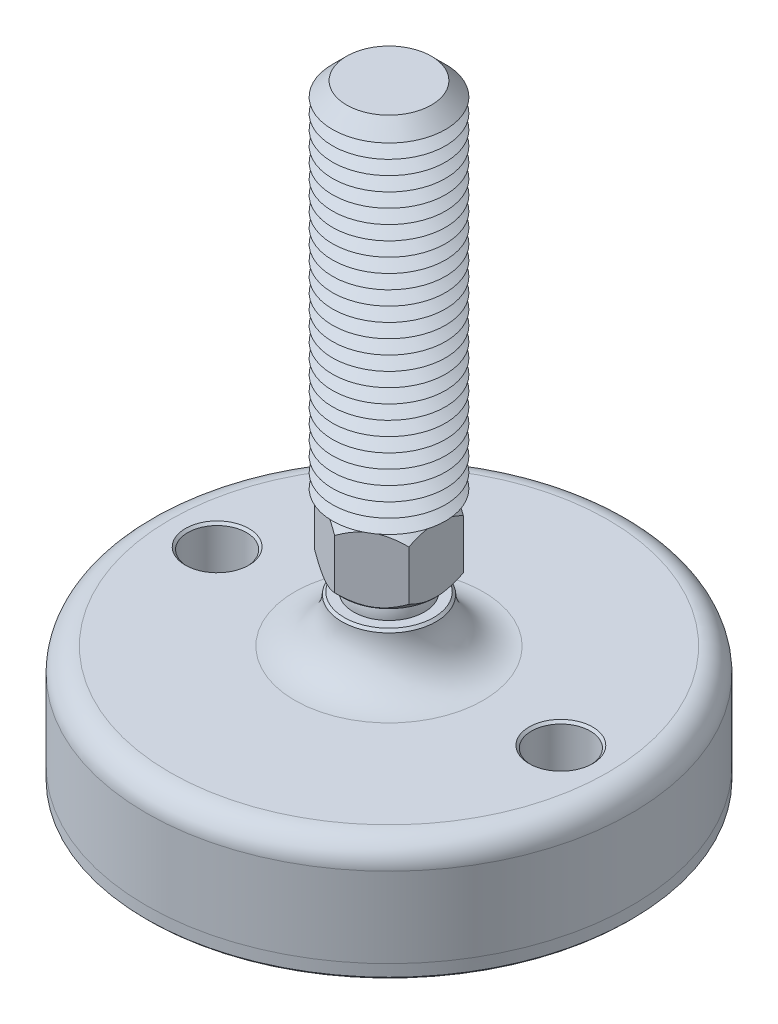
ISO-10303-21;
HEADER;
FILE_DESCRIPTION(('STEP AP214'),'2;1');
FILE_NAME('part.step','',(''),(''),'','','');
FILE_SCHEMA(('AUTOMOTIVE_DESIGN { 1 0 10303 214 1 1 1 1 }'));
ENDSEC;
DATA;
#1=APPLICATION_CONTEXT('core data for automotive mechanical design processes');
#2=APPLICATION_PROTOCOL_DEFINITION('international standard','automotive_design',2000,#1);
#3=PRODUCT_CONTEXT('',#1,'mechanical');
#4=PRODUCT('Part','Part','',(#3));
#5=PRODUCT_RELATED_PRODUCT_CATEGORY('part','',(#4));
#6=PRODUCT_DEFINITION_FORMATION('','',#4);
#7=PRODUCT_DEFINITION_CONTEXT('part definition',#1,'design');
#8=PRODUCT_DEFINITION('design','',#6,#7);
#9=PRODUCT_DEFINITION_SHAPE('','',#8);
#10=(LENGTH_UNIT() NAMED_UNIT(*) SI_UNIT(.MILLI.,.METRE.));
#11=(NAMED_UNIT(*) PLANE_ANGLE_UNIT() SI_UNIT($,.RADIAN.));
#12=(NAMED_UNIT(*) SI_UNIT($,.STERADIAN.) SOLID_ANGLE_UNIT());
#13=UNCERTAINTY_MEASURE_WITH_UNIT(LENGTH_MEASURE(1.E-05),#10,'distance_accuracy_value','');
#14=(GEOMETRIC_REPRESENTATION_CONTEXT(3) GLOBAL_UNCERTAINTY_ASSIGNED_CONTEXT((#13)) GLOBAL_UNIT_ASSIGNED_CONTEXT((#10,
#11,#12)) REPRESENTATION_CONTEXT('',''));
#15=CARTESIAN_POINT('',(0.,0.,0.));
#16=DIRECTION('',(0.,0.,1.));
#17=DIRECTION('',(1.,0.,0.));
#18=AXIS2_PLACEMENT_3D('',#15,#16,#17);
#19=CARTESIAN_POINT('',(0.,-32.,0.));
#20=DIRECTION('',(0.,1.,0.));
#21=DIRECTION('',(0.,0.,1.));
#22=AXIS2_PLACEMENT_3D('',#19,#20,#21);
#23=PLANE('',#22);
#24=CARTESIAN_POINT('',(-36.5,-32.,0.));
#25=DIRECTION('',(0.,1.,0.));
#26=DIRECTION('',(0.,0.,1.));
#27=AXIS2_PLACEMENT_3D('',#24,#25,#26);
#28=CIRCLE('',#27,6.25);
#29=CARTESIAN_POINT('',(-36.5,-32.,6.25));
#30=VERTEX_POINT('',#29);
#31=EDGE_CURVE('P0_E43',#30,#30,#28,.T.);
#32=ORIENTED_EDGE('',*,*,#31,.F.);
#33=EDGE_LOOP('',(#32));
#34=FACE_BOUND('',#33,.T.);
#35=CARTESIAN_POINT('',(36.5,-32.,0.));
#36=DIRECTION('',(0.,1.,0.));
#37=DIRECTION('',(0.,0.,1.));
#38=AXIS2_PLACEMENT_3D('',#35,#36,#37);
#39=CIRCLE('',#38,6.25);
#40=CARTESIAN_POINT('',(36.5,-32.,6.25));
#41=VERTEX_POINT('',#40);
#42=EDGE_CURVE('P0_E44',#41,#41,#39,.T.);
#43=ORIENTED_EDGE('',*,*,#42,.F.);
#44=EDGE_LOOP('',(#43));
#45=FACE_BOUND('',#44,.T.);
#46=CARTESIAN_POINT('',(0.,-32.,0.));
#47=DIRECTION('',(0.,1.,0.));
#48=DIRECTION('',(0.,0.,1.));
#49=AXIS2_PLACEMENT_3D('',#46,#47,#48);
#50=CIRCLE('',#49,51.5);
#51=CARTESIAN_POINT('',(0.,-32.,51.5));
#52=VERTEX_POINT('',#51);
#53=EDGE_CURVE('P0_E40',#52,#52,#50,.T.);
#54=ORIENTED_EDGE('',*,*,#53,.T.);
#55=EDGE_LOOP('',(#54));
#56=FACE_BOUND('',#55,.T.);
#57=ADVANCED_FACE('P0_F14',(#34,#45,#56),#23,.T.);
#58=CARTESIAN_POINT('',(0.,43.1654938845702,0.));
#59=DIRECTION('',(0.,1.,0.));
#60=DIRECTION('',(0.,0.,1.));
#61=AXIS2_PLACEMENT_3D('',#58,#59,#60);
#62=CYLINDRICAL_SURFACE('',#61,51.5);
#63=CARTESIAN_POINT('',(0.,-34.5,0.));
#64=DIRECTION('',(0.,-1.,0.));
#65=DIRECTION('',(0.,0.,-1.));
#66=AXIS2_PLACEMENT_3D('',#63,#64,#65);
#67=CIRCLE('',#66,51.5);
#68=CARTESIAN_POINT('',(0.,-34.5,-51.5));
#69=VERTEX_POINT('',#68);
#70=EDGE_CURVE('P0_E37',#69,#69,#67,.F.);
#71=ORIENTED_EDGE('',*,*,#70,.T.);
#72=EDGE_LOOP('',(#71));
#73=FACE_BOUND('',#72,.T.);
#74=ORIENTED_EDGE('',*,*,#53,.F.);
#75=EDGE_LOOP('',(#74));
#76=FACE_BOUND('',#75,.T.);
#77=ADVANCED_FACE('P0_F54',(#73,#76),#62,.T.);
#78=CARTESIAN_POINT('',(0.,-35.,51.5));
#79=DIRECTION('',(0.,-1.,0.));
#80=DIRECTION('',(0.,0.,-1.));
#81=AXIS2_PLACEMENT_3D('',#78,#79,#80);
#82=PLANE('',#81);
#83=CARTESIAN_POINT('',(36.5,-35.,0.));
#84=DIRECTION('',(0.,-1.,0.));
#85=DIRECTION('',(0.,0.,-1.));
#86=AXIS2_PLACEMENT_3D('',#83,#84,#85);
#87=CIRCLE('',#86,6.75000000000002);
#88=CARTESIAN_POINT('',(36.5,-35.,-6.75000000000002));
#89=VERTEX_POINT('',#88);
#90=EDGE_CURVE('P0_E25',#89,#89,#87,.F.);
#91=ORIENTED_EDGE('',*,*,#90,.T.);
#92=EDGE_LOOP('',(#91));
#93=FACE_BOUND('',#92,.T.);
#94=CARTESIAN_POINT('',(-36.5,-35.,0.));
#95=DIRECTION('',(0.,-1.,0.));
#96=DIRECTION('',(0.,0.,-1.));
#97=AXIS2_PLACEMENT_3D('',#94,#95,#96);
#98=CIRCLE('',#97,6.74999999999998);
#99=CARTESIAN_POINT('',(-36.5,-35.,-6.74999999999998));
#100=VERTEX_POINT('',#99);
#101=EDGE_CURVE('P0_E29',#100,#100,#98,.F.);
#102=ORIENTED_EDGE('',*,*,#101,.T.);
#103=EDGE_LOOP('',(#102));
#104=FACE_BOUND('',#103,.T.);
#105=CARTESIAN_POINT('',(0.,-35.,0.));
#106=DIRECTION('',(0.,-1.,0.));
#107=DIRECTION('',(0.,0.,-1.));
#108=AXIS2_PLACEMENT_3D('',#105,#106,#107);
#109=CIRCLE('',#108,51.);
#110=CARTESIAN_POINT('',(0.,-35.,-51.));
#111=VERTEX_POINT('',#110);
#112=EDGE_CURVE('P0_E34',#111,#111,#109,.T.);
#113=ORIENTED_EDGE('',*,*,#112,.T.);
#114=EDGE_LOOP('',(#113));
#115=FACE_BOUND('',#114,.T.);
#116=ADVANCED_FACE('P0_F61',(#93,#104,#115),#82,.T.);
#117=CARTESIAN_POINT('',(0.,-34.5,0.));
#118=DIRECTION('',(0.,1.,0.));
#119=DIRECTION('',(0.,0.,1.));
#120=AXIS2_PLACEMENT_3D('',#117,#118,#119);
#121=CONICAL_SURFACE('',#120,51.5,0.785398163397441);
#122=ORIENTED_EDGE('',*,*,#112,.F.);
#123=EDGE_LOOP('',(#122));
#124=FACE_BOUND('',#123,.T.);
#125=ORIENTED_EDGE('',*,*,#70,.F.);
#126=EDGE_LOOP('',(#125));
#127=FACE_BOUND('',#126,.T.);
#128=ADVANCED_FACE('P0_F68',(#124,#127),#121,.T.);
#129=CARTESIAN_POINT('',(36.5,-35.,0.));
#130=DIRECTION('',(0.,1.,0.));
#131=DIRECTION('',(0.,0.,1.));
#132=AXIS2_PLACEMENT_3D('',#129,#130,#131);
#133=CYLINDRICAL_SURFACE('',#132,6.25);
#134=CARTESIAN_POINT('',(36.5,-34.5,0.));
#135=DIRECTION('',(0.,-1.,0.));
#136=DIRECTION('',(0.,0.,-1.));
#137=AXIS2_PLACEMENT_3D('',#134,#135,#136);
#138=CIRCLE('',#137,6.25);
#139=CARTESIAN_POINT('',(36.5,-34.5,-6.25));
#140=VERTEX_POINT('',#139);
#141=EDGE_CURVE('P0_E21',#140,#140,#138,.T.);
#142=ORIENTED_EDGE('',*,*,#141,.T.);
#143=EDGE_LOOP('',(#142));
#144=FACE_BOUND('',#143,.T.);
#145=ORIENTED_EDGE('',*,*,#42,.T.);
#146=EDGE_LOOP('',(#145));
#147=FACE_BOUND('',#146,.T.);
#148=ADVANCED_FACE('P0_F74',(#144,#147),#133,.F.);
#149=CARTESIAN_POINT('',(-36.5,-35.,0.));
#150=DIRECTION('',(0.,1.,0.));
#151=DIRECTION('',(0.,0.,1.));
#152=AXIS2_PLACEMENT_3D('',#149,#150,#151);
#153=CYLINDRICAL_SURFACE('',#152,6.25);
#154=CARTESIAN_POINT('',(-36.5,-34.5,0.));
#155=DIRECTION('',(0.,-1.,0.));
#156=DIRECTION('',(0.,0.,-1.));
#157=AXIS2_PLACEMENT_3D('',#154,#155,#156);
#158=CIRCLE('',#157,6.25);
#159=CARTESIAN_POINT('',(-36.5,-34.5,-6.25));
#160=VERTEX_POINT('',#159);
#161=EDGE_CURVE('P0_E10',#160,#160,#158,.T.);
#162=ORIENTED_EDGE('',*,*,#161,.T.);
#163=EDGE_LOOP('',(#162));
#164=FACE_BOUND('',#163,.T.);
#165=ORIENTED_EDGE('',*,*,#31,.T.);
#166=EDGE_LOOP('',(#165));
#167=FACE_BOUND('',#166,.T.);
#168=ADVANCED_FACE('P0_F50',(#164,#167),#153,.F.);
#169=CARTESIAN_POINT('',(36.5,-35.,0.));
#170=DIRECTION('',(0.,-1.,0.));
#171=DIRECTION('',(0.,0.,-1.));
#172=AXIS2_PLACEMENT_3D('',#169,#170,#171);
#173=CONICAL_SURFACE('',#172,6.75000000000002,0.785398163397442);
#174=ORIENTED_EDGE('',*,*,#141,.F.);
#175=EDGE_LOOP('',(#174));
#176=FACE_BOUND('',#175,.T.);
#177=ORIENTED_EDGE('',*,*,#90,.F.);
#178=EDGE_LOOP('',(#177));
#179=FACE_BOUND('',#178,.T.);
#180=ADVANCED_FACE('P0_F76',(#176,#179),#173,.F.);
#181=CARTESIAN_POINT('',(-36.5,-35.,0.));
#182=DIRECTION('',(0.,-1.,0.));
#183=DIRECTION('',(0.,0.,-1.));
#184=AXIS2_PLACEMENT_3D('',#181,#182,#183);
#185=CONICAL_SURFACE('',#184,6.74999999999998,0.785398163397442);
#186=ORIENTED_EDGE('',*,*,#161,.F.);
#187=EDGE_LOOP('',(#186));
#188=FACE_BOUND('',#187,.T.);
#189=ORIENTED_EDGE('',*,*,#101,.F.);
#190=EDGE_LOOP('',(#189));
#191=FACE_BOUND('',#190,.T.);
#192=ADVANCED_FACE('P0_F16',(#188,#191),#185,.F.);
#193=CLOSED_SHELL('',(#57,#77,#116,#128,#148,#168,#180,#192));
#194=MANIFOLD_SOLID_BREP('P0_B1',#193);
#195=CARTESIAN_POINT('',(0.,3.75,0.));
#196=DIRECTION('',(0.,1.,0.));
#197=DIRECTION('',(0.,0.,1.));
#198=AXIS2_PLACEMENT_3D('',#195,#196,#197);
#199=PLANE('',#198);
#200=CARTESIAN_POINT('',(0.,3.75,0.));
#201=DIRECTION('',(0.,1.,0.));
#202=DIRECTION('',(0.,0.,1.));
#203=AXIS2_PLACEMENT_3D('',#200,#201,#202);
#204=CIRCLE('',#203,9.72829454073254);
#205=CARTESIAN_POINT('',(0.,3.75,9.72829454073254));
#206=VERTEX_POINT('',#205);
#207=EDGE_CURVE('P1_E211',#206,#206,#204,.T.);
#208=ORIENTED_EDGE('',*,*,#207,.F.);
#209=EDGE_LOOP('',(#208));
#210=FACE_BOUND('',#209,.T.);
#211=CARTESIAN_POINT('',(0.,3.75,0.));
#212=DIRECTION('',(0.,1.,0.));
#213=DIRECTION('',(0.,0.,1.));
#214=AXIS2_PLACEMENT_3D('',#211,#212,#213);
#215=CIRCLE('',#214,6.49519052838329);
#216=CARTESIAN_POINT('',(0.,3.75,6.49519052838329));
#217=VERTEX_POINT('',#216);
#218=EDGE_CURVE('P1_E24',#217,#217,#215,.F.);
#219=ORIENTED_EDGE('',*,*,#218,.F.);
#220=EDGE_LOOP('',(#219));
#221=FACE_BOUND('',#220,.T.);
#222=ADVANCED_FACE('P1_F16',(#210,#221),#199,.F.);
#223=CARTESIAN_POINT('',(0.,0.,0.));
#224=DIRECTION('',(0.,1.,0.));
#225=DIRECTION('',(0.,0.,-1.));
#226=AXIS2_PLACEMENT_3D('',#223,#224,#225);
#227=SPHERICAL_SURFACE('',#226,7.5);
#228=ORIENTED_EDGE('',*,*,#218,.T.);
#229=EDGE_LOOP('',(#228));
#230=FACE_BOUND('',#229,.T.);
#231=ADVANCED_FACE('P1_F201',(#230),#227,.T.);
#232=CARTESIAN_POINT('',(0.,3.75,0.));
#233=DIRECTION('',(0.,1.,0.));
#234=DIRECTION('',(0.,0.,1.));
#235=AXIS2_PLACEMENT_3D('',#232,#233,#234);
#236=CONICAL_SURFACE('',#235,9.72829454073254,0.785398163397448);
#237=ORIENTED_EDGE('',*,*,#207,.T.);
#238=EDGE_LOOP('',(#237));
#239=FACE_BOUND('',#238,.T.);
#240=CARTESIAN_POINT('',(-10.,9.59571642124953,-11.9394228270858));
#241=CARTESIAN_POINT('',(-10.,9.37430561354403,-11.6505452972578));
#242=CARTESIAN_POINT('',(-10.,9.15490936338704,-11.3600988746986));
#243=CARTESIAN_POINT('',(-10.,8.72106267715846,-10.7754314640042));
#244=CARTESIAN_POINT('',(-10.,8.50661343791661,-10.4812095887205));
#245=CARTESIAN_POINT('',(-10.,8.08205114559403,-9.88620330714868));
#246=CARTESIAN_POINT('',(-10.,7.87198437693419,-9.58538576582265));
#247=CARTESIAN_POINT('',(-10.,7.45926520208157,-8.97872312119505));
#248=CARTESIAN_POINT('',(-10.,7.25661228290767,-8.67287836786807));
#249=CARTESIAN_POINT('',(-10.,6.84809543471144,-8.03614350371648));
#250=CARTESIAN_POINT('',(-10.,6.64281401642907,-7.70487777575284));
#251=CARTESIAN_POINT('',(-10.,6.245142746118,-7.03457466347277));
#252=CARTESIAN_POINT('',(-10.,6.0527550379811,-6.69553599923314));
#253=CARTESIAN_POINT('',(-10.,5.68497951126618,-6.00961937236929));
#254=CARTESIAN_POINT('',(-10.,5.50954176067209,-5.66276839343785));
#255=CARTESIAN_POINT('',(-10.,5.17959635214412,-4.95932933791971));
#256=CARTESIAN_POINT('',(-10.,5.02507889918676,-4.60274591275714));
#257=CARTESIAN_POINT('',(-10.,4.75599518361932,-3.91353381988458));
#258=CARTESIAN_POINT('',(-10.,4.63902686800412,-3.58185263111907));
#259=CARTESIAN_POINT('',(-10.,4.43164927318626,-2.91013341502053));
#260=CARTESIAN_POINT('',(-10.,4.34124171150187,-2.57009484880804));
#261=CARTESIAN_POINT('',(-10.,4.19334931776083,-1.88955843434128));
#262=CARTESIAN_POINT('',(-10.,4.13527351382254,-1.54919119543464));
#263=CARTESIAN_POINT('',(-10.,4.05324021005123,-0.864347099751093));
#264=CARTESIAN_POINT('',(-10.,4.029275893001,-0.519871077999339));
#265=CARTESIAN_POINT('',(-10.,4.01745435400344,0.155191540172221));
#266=CARTESIAN_POINT('',(-10.,4.02812008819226,0.485752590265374));
#267=CARTESIAN_POINT('',(-10.,4.08160326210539,1.1442457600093));
#268=CARTESIAN_POINT('',(-10.,4.12442366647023,1.47217763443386));
#269=CARTESIAN_POINT('',(-10.,4.24054019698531,2.12859326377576));
#270=CARTESIAN_POINT('',(-10.,4.31437036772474,2.45698095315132));
#271=CARTESIAN_POINT('',(-10.,4.48844287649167,3.10654175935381));
#272=CARTESIAN_POINT('',(-10.,4.58868356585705,3.42771532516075));
#273=CARTESIAN_POINT('',(-10.,4.81839210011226,4.08271396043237));
#274=CARTESIAN_POINT('',(-10.,4.94932842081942,4.41601827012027));
#275=CARTESIAN_POINT('',(-10.,5.23140828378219,5.07403931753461));
#276=CARTESIAN_POINT('',(-10.,5.38256099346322,5.3987520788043));
#277=CARTESIAN_POINT('',(-10.,5.70148727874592,6.04113299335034));
#278=CARTESIAN_POINT('',(-10.,5.86931223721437,6.35877542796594));
#279=CARTESIAN_POINT('',(-10.,6.21788686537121,6.98677627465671));
#280=CARTESIAN_POINT('',(-10.,6.39863453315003,7.29713580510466));
#281=CARTESIAN_POINT('',(-10.,6.76133545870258,7.89633938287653));
#282=CARTESIAN_POINT('',(-10.,6.94278731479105,8.18548854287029));
#283=CARTESIAN_POINT('',(-10.,7.31339871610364,8.75881961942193));
#284=CARTESIAN_POINT('',(-10.,7.50255884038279,9.04300116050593));
#285=CARTESIAN_POINT('',(-10.,7.8856676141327,9.6047584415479));
#286=CARTESIAN_POINT('',(-10.,8.07956548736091,9.88236893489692));
#287=CARTESIAN_POINT('',(-10.,8.47254700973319,10.4337838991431));
#288=CARTESIAN_POINT('',(-10.,8.67162921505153,10.7075893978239));
#289=CARTESIAN_POINT('',(-10.,8.87283307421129,10.9797992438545));
#290=B_SPLINE_CURVE_WITH_KNOTS('',3,(#240,#241,#242,#243,#244,#245,#246,#247,#248,#249,#250,
#251,#252,#253,#254,#255,#256,#257,#258,#259,#260,#261,#262,#263,#264,#265,#266,#267,#268,#269,
#270,#271,#272,#273,#274,#275,#276,#277,#278,#279,#280,#281,#282,#283,#284,#285,#286,#287,#288,
#289),.UNSPECIFIED.,.F.,.F.,(4,2,2,2,2,2,2,2,2,2,2,2,2,2,2,2,2,2,2,2,2,2,2,2,4),(0.,
1.09192545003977,2.18411235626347,3.28473497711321,4.3852812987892,5.5541916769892,
6.72329593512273,7.88884387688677,9.05384420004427,10.1080362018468,11.1622963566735,
12.1965943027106,13.2306855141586,14.2212593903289,15.2119246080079,16.2203997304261,
17.2288119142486,18.3022883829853,19.3762532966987,20.4536373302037,21.5308548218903,
22.5548150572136,23.5788523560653,24.5946500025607,25.6101677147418),.UNSPECIFIED.);
#291=CARTESIAN_POINT('',(-10.,5.56871084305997,-5.77350269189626));
#292=VERTEX_POINT('',#291);
#293=CARTESIAN_POINT('',(-10.,5.56871084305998,5.77350269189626));
#294=VERTEX_POINT('',#293);
#295=EDGE_CURVE('P1_E185',#292,#294,#290,.T.);
#296=ORIENTED_EDGE('',*,*,#295,.F.);
#297=CARTESIAN_POINT('',(0.000199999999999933,5.56882631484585,-11.5471208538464));
#298=CARTESIAN_POINT('',(-0.171722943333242,5.4695807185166,-11.447861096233));
#299=CARTESIAN_POINT('',(-0.344992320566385,5.37336355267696,-11.3478239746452));
#300=CARTESIAN_POINT('',(-0.694433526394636,5.18794806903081,-11.1460740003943));
#301=CARTESIAN_POINT('',(-0.870606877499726,5.09875358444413,-11.0443602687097));
#302=CARTESIAN_POINT('',(-1.22689656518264,4.92796770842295,-10.8386563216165));
#303=CARTESIAN_POINT('',(-1.40702970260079,4.84642277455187,-10.7346564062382));
#304=CARTESIAN_POINT('',(-1.77025459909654,4.69270708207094,-10.52494841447));
#305=CARTESIAN_POINT('',(-1.95334590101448,4.62053489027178,-10.4192406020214));
#306=CARTESIAN_POINT('',(-2.31954331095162,4.4878482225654,-10.2078164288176));
#307=CARTESIAN_POINT('',(-2.50260441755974,4.42716910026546,-10.1021260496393));
#308=CARTESIAN_POINT('',(-2.87129282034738,4.31731511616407,-9.88926370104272));
#309=CARTESIAN_POINT('',(-3.05691983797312,4.26813901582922,-9.78209189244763));
#310=CARTESIAN_POINT('',(-3.42994608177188,4.1825291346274,-9.56672509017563));
#311=CARTESIAN_POINT('',(-3.61734032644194,4.14606667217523,-9.45853297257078));
#312=CARTESIAN_POINT('',(-3.99370204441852,4.08668528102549,-9.24124043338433));
#313=CARTESIAN_POINT('',(-4.1826692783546,4.06376432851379,-9.13214015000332));
#314=CARTESIAN_POINT('',(-4.64316633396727,4.0253323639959,-8.86627205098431));
#315=CARTESIAN_POINT('',(-4.91519388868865,4.01726744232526,-8.70921686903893));
#316=CARTESIAN_POINT('',(-5.45875701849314,4.03080424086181,-8.39539054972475));
#317=CARTESIAN_POINT('',(-5.7302923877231,4.05241636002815,-8.23861953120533));
#318=CARTESIAN_POINT('',(-6.27080349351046,4.12403157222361,-7.92655529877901));
#319=CARTESIAN_POINT('',(-6.53977602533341,4.17406641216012,-7.77126393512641));
#320=CARTESIAN_POINT('',(-7.07309796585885,4.29980733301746,-7.46335036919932));
#321=CARTESIAN_POINT('',(-7.33744772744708,4.3755114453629,-7.31072796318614));
#322=CARTESIAN_POINT('',(-7.80670351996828,4.53125365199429,-7.03980300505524));
#323=CARTESIAN_POINT('',(-8.01264886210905,4.60719488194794,-6.92090040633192));
#324=CARTESIAN_POINT('',(-8.42084280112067,4.77131434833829,-6.68522952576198));
#325=CARTESIAN_POINT('',(-8.62309128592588,4.85949295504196,-6.5684613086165));
#326=CARTESIAN_POINT('',(-9.02325448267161,5.04611070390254,-6.33742697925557));
#327=CARTESIAN_POINT('',(-9.22118057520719,5.1445175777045,-6.2231542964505));
#328=CARTESIAN_POINT('',(-9.61336795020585,5.35030005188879,-5.99672480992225));
#329=CARTESIAN_POINT('',(-9.80763139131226,5.45767015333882,-5.88456675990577));
#330=CARTESIAN_POINT('',(-10.0002,5.56882631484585,-5.77338722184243));
#331=B_SPLINE_CURVE_WITH_KNOTS('',3,(#297,#298,#299,#300,#301,#302,#303,#304,#305,#306,#307,
#308,#309,#310,#311,#312,#313,#314,#315,#316,#317,#318,#319,#320,#321,#322,#323,#324,#325,#326,
#327,#328,#329,#330),.UNSPECIFIED.,.F.,.F.,(4,2,2,2,2,2,2,2,2,2,2,2,2,2,2,2,4),(0.,
0.665863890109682,1.33208874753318,2.00212824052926,2.67206515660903,3.33152613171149,
3.99091606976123,4.64880867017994,5.30660292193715,6.24777541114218,7.18927777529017,
8.13183382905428,9.07431761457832,9.82287578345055,10.5714566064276,11.3177436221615,
12.0635761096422),.UNSPECIFIED.);
#332=CARTESIAN_POINT('',(0.,5.56871084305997,-11.5470053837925));
#333=VERTEX_POINT('',#332);
#334=EDGE_CURVE('P1_E179',#333,#292,#331,.T.);
#335=ORIENTED_EDGE('',*,*,#334,.F.);
#336=CARTESIAN_POINT('',(10.0002,5.56882631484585,-5.77338722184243));
#337=CARTESIAN_POINT('',(9.82827705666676,5.4695807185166,-5.87264697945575));
#338=CARTESIAN_POINT('',(9.65500767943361,5.37336355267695,-5.97268410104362));
#339=CARTESIAN_POINT('',(9.30556647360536,5.18794806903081,-6.17443407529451));
#340=CARTESIAN_POINT('',(9.12939312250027,5.09875358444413,-6.27614780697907));
#341=CARTESIAN_POINT('',(8.77310343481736,4.92796770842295,-6.48185175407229));
#342=CARTESIAN_POINT('',(8.59297029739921,4.84642277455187,-6.58585166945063));
#343=CARTESIAN_POINT('',(8.22974540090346,4.69270708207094,-6.79555966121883));
#344=CARTESIAN_POINT('',(8.04665409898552,4.62053489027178,-6.90126747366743));
#345=CARTESIAN_POINT('',(7.68045668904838,4.4878482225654,-7.11269164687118));
#346=CARTESIAN_POINT('',(7.49739558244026,4.42716910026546,-7.21838202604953));
#347=CARTESIAN_POINT('',(7.12870717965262,4.31731511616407,-7.43124437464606));
#348=CARTESIAN_POINT('',(6.94308016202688,4.26813901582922,-7.53841618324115));
#349=CARTESIAN_POINT('',(6.57005391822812,4.1825291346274,-7.75378298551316));
#350=CARTESIAN_POINT('',(6.38265967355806,4.14606667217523,-7.861975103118));
#351=CARTESIAN_POINT('',(6.00629795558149,4.08668528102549,-8.07926764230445));
#352=CARTESIAN_POINT('',(5.81733072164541,4.06376432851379,-8.18836792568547));
#353=CARTESIAN_POINT('',(5.35683366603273,4.0253323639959,-8.45423602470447));
#354=CARTESIAN_POINT('',(5.08480611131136,4.01726744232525,-8.61129120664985));
#355=CARTESIAN_POINT('',(4.54124298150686,4.03080424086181,-8.92511752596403));
#356=CARTESIAN_POINT('',(4.2697076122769,4.05241636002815,-9.08188854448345));
#357=CARTESIAN_POINT('',(3.72919650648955,4.12403157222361,-9.39395277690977));
#358=CARTESIAN_POINT('',(3.46022397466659,4.17406641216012,-9.54924414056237));
#359=CARTESIAN_POINT('',(2.92690203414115,4.29980733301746,-9.85715770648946));
#360=CARTESIAN_POINT('',(2.66255227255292,4.37551144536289,-10.0097801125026));
#361=CARTESIAN_POINT('',(2.19329648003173,4.53125365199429,-10.2807050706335));
#362=CARTESIAN_POINT('',(1.98735113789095,4.60719488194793,-10.3996076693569));
#363=CARTESIAN_POINT('',(1.57915719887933,4.77131434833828,-10.6352785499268));
#364=CARTESIAN_POINT('',(1.37690871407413,4.85949295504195,-10.7520467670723));
#365=CARTESIAN_POINT('',(0.976745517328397,5.04611070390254,-10.9830810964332));
#366=CARTESIAN_POINT('',(0.77881942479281,5.1445175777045,-11.0973537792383));
#367=CARTESIAN_POINT('',(0.386632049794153,5.35030005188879,-11.3237832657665));
#368=CARTESIAN_POINT('',(0.192368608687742,5.45767015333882,-11.435941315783));
#369=CARTESIAN_POINT('',(-0.000199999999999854,5.56882631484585,-11.5471208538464));
#370=B_SPLINE_CURVE_WITH_KNOTS('',3,(#336,#337,#338,#339,#340,#341,#342,#343,#344,#345,#346,
#347,#348,#349,#350,#351,#352,#353,#354,#355,#356,#357,#358,#359,#360,#361,#362,#363,#364,#365,
#366,#367,#368,#369),.UNSPECIFIED.,.F.,.F.,(4,2,2,2,2,2,2,2,2,2,2,2,2,2,2,2,4),(0.,
0.665863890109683,1.33208874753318,2.00212824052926,2.67206515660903,3.33152613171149,
3.99091606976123,4.64880867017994,5.30660292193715,6.24777541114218,7.18927777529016,
8.13183382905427,9.07431761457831,9.82287578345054,10.5714566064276,11.3177436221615,
12.0635761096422),.UNSPECIFIED.);
#371=CARTESIAN_POINT('',(9.99999999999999,5.56871084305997,-5.77350269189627));
#372=VERTEX_POINT('',#371);
#373=EDGE_CURVE('P1_E167',#372,#333,#370,.T.);
#374=ORIENTED_EDGE('',*,*,#373,.F.);
#375=CARTESIAN_POINT('',(10.,9.59571642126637,-11.9394228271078));
#376=CARTESIAN_POINT('',(10.,9.37430561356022,-11.6505452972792));
#377=CARTESIAN_POINT('',(10.,9.15490936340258,-11.3600988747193));
#378=CARTESIAN_POINT('',(10.,8.7210626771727,-10.7754314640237));
#379=CARTESIAN_POINT('',(10.,8.5066134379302,-10.4812095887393));
#380=CARTESIAN_POINT('',(10.,8.08205114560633,-9.88620330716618));
#381=CARTESIAN_POINT('',(10.,7.87198437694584,-9.58538576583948));
#382=CARTESIAN_POINT('',(10.,7.45926520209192,-8.97872312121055));
#383=CARTESIAN_POINT('',(10.,7.25661228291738,-8.67287836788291));
#384=CARTESIAN_POINT('',(10.,6.84809543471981,-8.03614350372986));
#385=CARTESIAN_POINT('',(10.,6.64281401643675,-7.70487777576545));
#386=CARTESIAN_POINT('',(10.,6.24514274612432,-7.03457466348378));
#387=CARTESIAN_POINT('',(10.,6.05275503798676,-6.69553599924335));
#388=CARTESIAN_POINT('',(10.,5.68497951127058,-6.00961937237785));
#389=CARTESIAN_POINT('',(10.,5.50954176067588,-5.66276839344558));
#390=CARTESIAN_POINT('',(10.,5.17959635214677,-4.95932933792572));
#391=CARTESIAN_POINT('',(10.,5.02507889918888,-4.60274591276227));
#392=CARTESIAN_POINT('',(10.,4.75599518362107,-3.91353381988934));
#393=CARTESIAN_POINT('',(10.,4.63902686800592,-3.58185263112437));
#394=CARTESIAN_POINT('',(10.,4.43164927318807,-2.91013341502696));
#395=CARTESIAN_POINT('',(10.,4.34124171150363,-2.57009484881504));
#396=CARTESIAN_POINT('',(10.,4.19334931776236,-1.8895584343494));
#397=CARTESIAN_POINT('',(10.,4.13527351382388,-1.54919119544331));
#398=CARTESIAN_POINT('',(10.,4.05324021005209,-0.86434709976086));
#399=CARTESIAN_POINT('',(10.,4.02927589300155,-0.519871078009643));
#400=CARTESIAN_POINT('',(10.,4.01745435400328,0.155191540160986));
#401=CARTESIAN_POINT('',(10.,4.0281200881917,0.485752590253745));
#402=CARTESIAN_POINT('',(10.,4.08160326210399,1.14424575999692));
#403=CARTESIAN_POINT('',(10.,4.12442366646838,1.47217763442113));
#404=CARTESIAN_POINT('',(10.,4.24054019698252,2.12859326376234));
#405=CARTESIAN_POINT('',(10.,4.31437036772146,2.45698095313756));
#406=CARTESIAN_POINT('',(10.,4.48844287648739,3.1065417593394));
#407=CARTESIAN_POINT('',(10.,4.58868356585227,3.42771532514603));
#408=CARTESIAN_POINT('',(10.,4.81839210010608,4.08271396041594));
#409=CARTESIAN_POINT('',(10.,4.94932842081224,4.41601827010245));
#410=CARTESIAN_POINT('',(10.,5.23140828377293,5.0740393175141));
#411=CARTESIAN_POINT('',(10.,5.38256099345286,5.39875207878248));
#412=CARTESIAN_POINT('',(10.,5.70148727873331,6.04113299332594));
#413=CARTESIAN_POINT('',(10.,5.86931223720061,6.35877542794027));
#414=CARTESIAN_POINT('',(10.,6.21788686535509,6.98677627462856));
#415=CARTESIAN_POINT('',(10.,6.39863453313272,7.29713580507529));
#416=CARTESIAN_POINT('',(10.,6.761335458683,7.89633938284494));
#417=CARTESIAN_POINT('',(10.,6.9427873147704,8.18548854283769));
#418=CARTESIAN_POINT('',(10.,7.31339871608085,8.75881961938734));
#419=CARTESIAN_POINT('',(10.,7.50255884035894,9.04300116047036));
#420=CARTESIAN_POINT('',(10.,7.88566761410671,9.60475844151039));
#421=CARTESIAN_POINT('',(10.,8.07956548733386,9.88236893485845));
#422=CARTESIAN_POINT('',(10.,8.47254700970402,10.4337838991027));
#423=CARTESIAN_POINT('',(10.,8.6716292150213,10.7075893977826));
#424=CARTESIAN_POINT('',(10.,8.87283307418,10.9797992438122));
#425=B_SPLINE_CURVE_WITH_KNOTS('',3,(#375,#376,#377,#378,#379,#380,#381,#382,#383,#384,#385,
#386,#387,#388,#389,#390,#391,#392,#393,#394,#395,#396,#397,#398,#399,#400,#401,#402,#403,#404,
#405,#406,#407,#408,#409,#410,#411,#412,#413,#414,#415,#416,#417,#418,#419,#420,#421,#422,#423,
#424),.UNSPECIFIED.,.F.,.F.,(4,2,2,2,2,2,2,2,2,2,2,2,2,2,2,2,2,2,2,2,2,2,2,2,4),(0.,
1.09192545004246,2.18411235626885,3.28473497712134,4.38528129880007,5.55419167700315,
6.72329593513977,7.88884387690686,9.05384420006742,10.1080362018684,11.1622963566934,
12.196594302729,13.2306855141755,14.2212593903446,15.2119246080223,16.2203997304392,
17.2288119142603,18.3022883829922,19.3762532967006,20.4536373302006,21.5308548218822,
22.5548150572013,23.5788523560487,24.5946500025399,25.6101677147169),.UNSPECIFIED.);
#426=CARTESIAN_POINT('',(10.,5.56871084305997,5.77350269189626));
#427=VERTEX_POINT('',#426);
#428=EDGE_CURVE('P1_E70',#427,#372,#425,.F.);
#429=ORIENTED_EDGE('',*,*,#428,.F.);
#430=CARTESIAN_POINT('',(-0.000200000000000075,5.56882631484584,11.5471208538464));
#431=CARTESIAN_POINT('',(0.171722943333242,5.4695807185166,11.447861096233));
#432=CARTESIAN_POINT('',(0.344992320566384,5.37336355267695,11.3478239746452));
#433=CARTESIAN_POINT('',(0.694433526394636,5.18794806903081,11.1460740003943));
#434=CARTESIAN_POINT('',(0.870606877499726,5.09875358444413,11.0443602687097));
#435=CARTESIAN_POINT('',(1.22689656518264,4.92796770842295,10.8386563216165));
#436=CARTESIAN_POINT('',(1.40702970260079,4.84642277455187,10.7346564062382));
#437=CARTESIAN_POINT('',(1.77025459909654,4.69270708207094,10.52494841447));
#438=CARTESIAN_POINT('',(1.95334590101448,4.62053489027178,10.4192406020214));
#439=CARTESIAN_POINT('',(2.31954331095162,4.4878482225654,10.2078164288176));
#440=CARTESIAN_POINT('',(2.50260441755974,4.42716910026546,10.1021260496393));
#441=CARTESIAN_POINT('',(2.87129282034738,4.31731511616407,9.88926370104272));
#442=CARTESIAN_POINT('',(3.05691983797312,4.26813901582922,9.78209189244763));
#443=CARTESIAN_POINT('',(3.42994608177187,4.18252913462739,9.56672509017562));
#444=CARTESIAN_POINT('',(3.61734032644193,4.14606667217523,9.45853297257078));
#445=CARTESIAN_POINT('',(3.99370204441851,4.08668528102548,9.24124043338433));
#446=CARTESIAN_POINT('',(4.18266927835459,4.06376432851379,9.13214015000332));
#447=CARTESIAN_POINT('',(4.64316633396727,4.0253323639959,8.86627205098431));
#448=CARTESIAN_POINT('',(4.91519388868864,4.01726744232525,8.70921686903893));
#449=CARTESIAN_POINT('',(5.45875701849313,4.03080424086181,8.39539054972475));
#450=CARTESIAN_POINT('',(5.7302923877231,4.05241636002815,8.23861953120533));
#451=CARTESIAN_POINT('',(6.27080349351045,4.1240315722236,7.92655529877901));
#452=CARTESIAN_POINT('',(6.53977602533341,4.17406641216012,7.77126393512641));
#453=CARTESIAN_POINT('',(7.07309796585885,4.29980733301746,7.46335036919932));
#454=CARTESIAN_POINT('',(7.33744772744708,4.37551144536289,7.31072796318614));
#455=CARTESIAN_POINT('',(7.80670351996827,4.53125365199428,7.03980300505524));
#456=CARTESIAN_POINT('',(8.01264886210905,4.60719488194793,6.92090040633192));
#457=CARTESIAN_POINT('',(8.42084280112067,4.77131434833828,6.68522952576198));
#458=CARTESIAN_POINT('',(8.62309128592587,4.85949295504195,6.5684613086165));
#459=CARTESIAN_POINT('',(9.0232544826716,5.04611070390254,6.33742697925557));
#460=CARTESIAN_POINT('',(9.22118057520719,5.1445175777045,6.2231542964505));
#461=CARTESIAN_POINT('',(9.61336795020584,5.35030005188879,5.99672480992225));
#462=CARTESIAN_POINT('',(9.80763139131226,5.45767015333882,5.88456675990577));
#463=CARTESIAN_POINT('',(10.0002,5.56882631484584,5.77338722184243));
#464=B_SPLINE_CURVE_WITH_KNOTS('',3,(#430,#431,#432,#433,#434,#435,#436,#437,#438,#439,#440,
#441,#442,#443,#444,#445,#446,#447,#448,#449,#450,#451,#452,#453,#454,#455,#456,#457,#458,#459,
#460,#461,#462,#463),.UNSPECIFIED.,.F.,.F.,(4,2,2,2,2,2,2,2,2,2,2,2,2,2,2,2,4),(0.,
0.665863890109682,1.33208874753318,2.00212824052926,2.67206515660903,3.33152613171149,
3.99091606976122,4.64880867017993,5.30660292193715,6.24777541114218,7.18927777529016,
8.13183382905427,9.07431761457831,9.82287578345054,10.5714566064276,11.3177436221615,
12.0635761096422),.UNSPECIFIED.);
#465=CARTESIAN_POINT('',(0.,5.56871084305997,11.5470053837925));
#466=VERTEX_POINT('',#465);
#467=EDGE_CURVE('P1_E67',#466,#427,#464,.T.);
#468=ORIENTED_EDGE('',*,*,#467,.F.);
#469=CARTESIAN_POINT('',(-10.0002,5.56882631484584,5.77338722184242));
#470=CARTESIAN_POINT('',(-9.82827705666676,5.4695807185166,5.87264697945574));
#471=CARTESIAN_POINT('',(-9.65500767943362,5.37336355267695,5.97268410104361));
#472=CARTESIAN_POINT('',(-9.30556647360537,5.18794806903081,6.1744340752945));
#473=CARTESIAN_POINT('',(-9.12939312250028,5.09875358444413,6.27614780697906));
#474=CARTESIAN_POINT('',(-8.77310343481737,4.92796770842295,6.48185175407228));
#475=CARTESIAN_POINT('',(-8.59297029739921,4.84642277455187,6.58585166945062));
#476=CARTESIAN_POINT('',(-8.22974540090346,4.69270708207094,6.79555966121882));
#477=CARTESIAN_POINT('',(-8.04665409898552,4.62053489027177,6.90126747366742));
#478=CARTESIAN_POINT('',(-7.68045668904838,4.48784822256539,7.11269164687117));
#479=CARTESIAN_POINT('',(-7.49739558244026,4.42716910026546,7.21838202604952));
#480=CARTESIAN_POINT('',(-7.12870717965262,4.31731511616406,7.43124437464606));
#481=CARTESIAN_POINT('',(-6.94308016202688,4.26813901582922,7.53841618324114));
#482=CARTESIAN_POINT('',(-6.57005391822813,4.18252913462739,7.75378298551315));
#483=CARTESIAN_POINT('',(-6.38265967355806,4.14606667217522,7.861975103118));
#484=CARTESIAN_POINT('',(-6.00629795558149,4.08668528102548,8.07926764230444));
#485=CARTESIAN_POINT('',(-5.81733072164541,4.06376432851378,8.18836792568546));
#486=CARTESIAN_POINT('',(-5.35683366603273,4.0253323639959,8.45423602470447));
#487=CARTESIAN_POINT('',(-5.08480611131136,4.01726744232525,8.61129120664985));
#488=CARTESIAN_POINT('',(-4.54124298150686,4.0308042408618,8.92511752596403));
#489=CARTESIAN_POINT('',(-4.2697076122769,4.05241636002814,9.08188854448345));
#490=CARTESIAN_POINT('',(-3.72919650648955,4.1240315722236,9.39395277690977));
#491=CARTESIAN_POINT('',(-3.46022397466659,4.17406641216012,9.54924414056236));
#492=CARTESIAN_POINT('',(-2.92690203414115,4.29980733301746,9.85715770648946));
#493=CARTESIAN_POINT('',(-2.66255227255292,4.37551144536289,10.0097801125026));
#494=CARTESIAN_POINT('',(-2.19329648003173,4.53125365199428,10.2807050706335));
#495=CARTESIAN_POINT('',(-1.98735113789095,4.60719488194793,10.3996076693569));
#496=CARTESIAN_POINT('',(-1.57915719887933,4.77131434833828,10.6352785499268));
#497=CARTESIAN_POINT('',(-1.37690871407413,4.85949295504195,10.7520467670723));
#498=CARTESIAN_POINT('',(-0.976745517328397,5.04611070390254,10.9830810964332));
#499=CARTESIAN_POINT('',(-0.778819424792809,5.1445175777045,11.0973537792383));
#500=CARTESIAN_POINT('',(-0.386632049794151,5.35030005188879,11.3237832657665));
#501=CARTESIAN_POINT('',(-0.192368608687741,5.45767015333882,11.435941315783));
#502=CARTESIAN_POINT('',(0.000199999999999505,5.56882631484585,11.5471208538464));
#503=B_SPLINE_CURVE_WITH_KNOTS('',3,(#469,#470,#471,#472,#473,#474,#475,#476,#477,#478,#479,
#480,#481,#482,#483,#484,#485,#486,#487,#488,#489,#490,#491,#492,#493,#494,#495,#496,#497,#498,
#499,#500,#501,#502),.UNSPECIFIED.,.F.,.F.,(4,2,2,2,2,2,2,2,2,2,2,2,2,2,2,2,4),(0.,
0.665863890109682,1.33208874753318,2.00212824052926,2.67206515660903,3.33152613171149,
3.99091606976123,4.64880867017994,5.30660292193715,6.24777541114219,7.18927777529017,
8.13183382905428,9.07431761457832,9.82287578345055,10.5714566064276,11.3177436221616,
12.0635761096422),.UNSPECIFIED.);
#504=EDGE_CURVE('P1_E39',#294,#466,#503,.T.);
#505=ORIENTED_EDGE('',*,*,#504,.F.);
#506=EDGE_LOOP('',(#296,#335,#374,#429,#468,#505));
#507=FACE_BOUND('',#506,.T.);
#508=ADVANCED_FACE('P1_F68',(#239,#507),#236,.T.);
#509=CARTESIAN_POINT('',(-10.,19.,-5.77350269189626));
#510=DIRECTION('',(1.,0.,0.));
#511=DIRECTION('',(0.,0.,-1.));
#512=AXIS2_PLACEMENT_3D('',#509,#510,#511);
#513=PLANE('',#512);
#514=DIRECTION('',(0.,-1.,0.));
#515=VECTOR('',#514,1.);
#516=CARTESIAN_POINT('',(-10.,19.,5.77350269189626));
#517=LINE('',#516,#515);
#518=CARTESIAN_POINT('',(-10.,16.1132486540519,5.77350269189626));
#519=VERTEX_POINT('',#518);
#520=EDGE_CURVE('P1_E83',#519,#294,#517,.T.);
#521=ORIENTED_EDGE('',*,*,#520,.F.);
#522=CARTESIAN_POINT('',(-10.,12.4093918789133,-11.5147208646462));
#523=CARTESIAN_POINT('',(-10.,12.6210295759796,-11.2343500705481));
#524=CARTESIAN_POINT('',(-10.,12.8306215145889,-10.9524094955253));
#525=CARTESIAN_POINT('',(-10.,13.2447979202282,-10.3847695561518));
#526=CARTESIAN_POINT('',(-10.,13.4493811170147,-10.0990692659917));
#527=CARTESIAN_POINT('',(-10.,13.8540786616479,-9.52120077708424));
#528=CARTESIAN_POINT('',(-10.,14.0541461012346,-9.22899961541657));
#529=CARTESIAN_POINT('',(-10.,14.4468132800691,-8.63963749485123));
#530=CARTESIAN_POINT('',(-10.,14.6394135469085,-8.34247688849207));
#531=CARTESIAN_POINT('',(-10.,15.0262335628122,-7.72525702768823));
#532=CARTESIAN_POINT('',(-10.,15.2199166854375,-7.40485974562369));
#533=CARTESIAN_POINT('',(-10.,15.5945399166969,-6.75658646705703));
#534=CARTESIAN_POINT('',(-10.,15.7754780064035,-6.4287092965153));
#535=CARTESIAN_POINT('',(-10.,16.1207071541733,-5.76550673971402));
#536=CARTESIAN_POINT('',(-10.,16.285047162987,-5.43020703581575));
#537=CARTESIAN_POINT('',(-10.,16.5934011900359,-4.75046311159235));
#538=CARTESIAN_POINT('',(-10.,16.7374244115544,-4.40602311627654));
#539=CARTESIAN_POINT('',(-10.,16.9894496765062,-3.73558113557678));
#540=CARTESIAN_POINT('',(-10.,17.0994177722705,-3.41032595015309));
#541=CARTESIAN_POINT('',(-10.,17.2932601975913,-2.75198473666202));
#542=CARTESIAN_POINT('',(-10.,17.377132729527,-2.4188981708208));
#543=CARTESIAN_POINT('',(-10.,17.5130086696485,-1.7524231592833));
#544=CARTESIAN_POINT('',(-10.,17.565558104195,-1.41914787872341));
#545=CARTESIAN_POINT('',(-10.,17.6377678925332,-0.749034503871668));
#546=CARTESIAN_POINT('',(-10.,17.6574338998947,-0.412197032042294));
#547=CARTESIAN_POINT('',(-10.,17.6624162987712,0.249527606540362));
#548=CARTESIAN_POINT('',(-10.,17.6489502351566,0.574406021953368));
#549=CARTESIAN_POINT('',(-10.,17.5910984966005,1.22138001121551));
#550=CARTESIAN_POINT('',(-10.,17.5467098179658,1.54347531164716));
#551=CARTESIAN_POINT('',(-10.,17.4286795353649,2.18799750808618));
#552=CARTESIAN_POINT('',(-10.,17.3545401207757,2.51033177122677));
#553=CARTESIAN_POINT('',(-10.,17.180962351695,3.14797698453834));
#554=CARTESIAN_POINT('',(-10.,17.0815261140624,3.46328851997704));
#555=CARTESIAN_POINT('',(-10.,16.8512186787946,4.11544298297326));
#556=CARTESIAN_POINT('',(-10.,16.7182795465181,4.45154819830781));
#557=CARTESIAN_POINT('',(-10.,16.431992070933,5.115028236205));
#558=CARTESIAN_POINT('',(-10.,16.2786342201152,5.4423989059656));
#559=CARTESIAN_POINT('',(-10.,15.9551580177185,6.09000973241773));
#560=CARTESIAN_POINT('',(-10.,15.7849870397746,6.41022338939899));
#561=CARTESIAN_POINT('',(-10.,15.4316458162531,7.04328175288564));
#562=CARTESIAN_POINT('',(-10.,15.2484776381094,7.35612762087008));
#563=CARTESIAN_POINT('',(-10.,14.8810750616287,7.96002022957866));
#564=CARTESIAN_POINT('',(-10.,14.6973474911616,8.25137695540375));
#565=CARTESIAN_POINT('',(-10.,14.3221662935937,8.82908851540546));
#566=CARTESIAN_POINT('',(-10.,14.1307120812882,9.1154429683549));
#567=CARTESIAN_POINT('',(-10.,13.7430400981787,9.68148259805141));
#568=CARTESIAN_POINT('',(-10.,13.5468736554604,9.96120305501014));
#569=CARTESIAN_POINT('',(-10.,13.149353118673,10.5168212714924));
#570=CARTESIAN_POINT('',(-10.,12.9480004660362,10.7927200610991));
#571=CARTESIAN_POINT('',(-10.,12.7445274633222,11.0670185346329));
#572=B_SPLINE_CURVE_WITH_KNOTS('',3,(#522,#523,#524,#525,#526,#527,#528,#529,#530,#531,#532,
#533,#534,#535,#536,#537,#538,#539,#540,#541,#542,#543,#544,#545,#546,#547,#548,#549,#550,#551,
#552,#553,#554,#555,#556,#557,#558,#559,#560,#561,#562,#563,#564,#565,#566,#567,#568,#569,#570,
#571),.UNSPECIFIED.,.F.,.F.,(4,2,2,2,2,2,2,2,2,2,2,2,2,2,2,2,2,2,2,2,2,2,2,2,4),(0.,
1.05386365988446,2.10799187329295,3.17028777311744,4.23250847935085,5.35544154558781,
6.47855209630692,7.5982472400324,8.71743353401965,9.74655549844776,10.7757483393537,
11.7864315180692,12.7969409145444,13.7708741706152,14.7449020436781,15.7359570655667,
16.7269291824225,17.8104078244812,18.8943927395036,19.981885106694,21.0692048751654,
22.1024062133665,23.1356859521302,24.1605722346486,25.1851766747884),.UNSPECIFIED.);
#573=CARTESIAN_POINT('',(-10.,16.1132486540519,-5.77350269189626));
#574=VERTEX_POINT('',#573);
#575=EDGE_CURVE('P1_E84',#519,#574,#572,.F.);
#576=ORIENTED_EDGE('',*,*,#575,.T.);
#577=DIRECTION('',(0.,-1.,0.));
#578=VECTOR('',#577,1.);
#579=CARTESIAN_POINT('',(-10.,19.,-5.77350269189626));
#580=LINE('',#579,#578);
#581=EDGE_CURVE('P1_E100',#574,#292,#580,.T.);
#582=ORIENTED_EDGE('',*,*,#581,.T.);
#583=ORIENTED_EDGE('',*,*,#295,.T.);
#584=EDGE_LOOP('',(#521,#576,#582,#583));
#585=FACE_BOUND('',#584,.T.);
#586=ADVANCED_FACE('P1_F193',(#585),#513,.F.);
#587=CARTESIAN_POINT('',(0.,19.,-11.5470053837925));
#588=DIRECTION('',(0.5,0.,0.866025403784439));
#589=DIRECTION('',(0.866025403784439,0.,-0.5));
#590=AXIS2_PLACEMENT_3D('',#587,#588,#589);
#591=PLANE('',#590);
#592=ORIENTED_EDGE('',*,*,#581,.F.);
#593=CARTESIAN_POINT('',(-10.0002,16.113133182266,-5.77338722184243));
#594=CARTESIAN_POINT('',(-9.82827705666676,16.2123787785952,-5.87264697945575));
#595=CARTESIAN_POINT('',(-9.65500767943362,16.3085959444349,-5.97268410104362));
#596=CARTESIAN_POINT('',(-9.30556647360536,16.494011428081,-6.17443407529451));
#597=CARTESIAN_POINT('',(-9.12939312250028,16.5832059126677,-6.27614780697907));
#598=CARTESIAN_POINT('',(-8.77310343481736,16.7539917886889,-6.48185175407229));
#599=CARTESIAN_POINT('',(-8.59297029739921,16.83553672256,-6.58585166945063));
#600=CARTESIAN_POINT('',(-8.22974540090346,16.9892524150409,-6.79555966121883));
#601=CARTESIAN_POINT('',(-8.04665409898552,17.0614246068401,-6.90126747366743));
#602=CARTESIAN_POINT('',(-7.68045668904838,17.1941112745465,-7.11269164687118));
#603=CARTESIAN_POINT('',(-7.49739558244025,17.2547903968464,-7.21838202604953));
#604=CARTESIAN_POINT('',(-7.12870717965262,17.3646443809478,-7.43124437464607));
#605=CARTESIAN_POINT('',(-6.94308016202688,17.4138204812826,-7.53841618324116));
#606=CARTESIAN_POINT('',(-6.57005391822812,17.4994303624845,-7.75378298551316));
#607=CARTESIAN_POINT('',(-6.38265967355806,17.5358928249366,-7.86197510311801));
#608=CARTESIAN_POINT('',(-6.00629795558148,17.5952742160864,-8.07926764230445));
#609=CARTESIAN_POINT('',(-5.8173307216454,17.6181951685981,-8.18836792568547));
#610=CARTESIAN_POINT('',(-5.35683366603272,17.6566271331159,-8.45423602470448));
#611=CARTESIAN_POINT('',(-5.08480611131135,17.6646920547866,-8.61129120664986));
#612=CARTESIAN_POINT('',(-4.54124298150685,17.65115525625,-8.92511752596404));
#613=CARTESIAN_POINT('',(-4.26970761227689,17.6295431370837,-9.08188854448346));
#614=CARTESIAN_POINT('',(-3.72919650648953,17.5579279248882,-9.39395277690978));
#615=CARTESIAN_POINT('',(-3.46022397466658,17.5078930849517,-9.54924414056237));
#616=CARTESIAN_POINT('',(-2.92690203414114,17.3821521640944,-9.85715770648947));
#617=CARTESIAN_POINT('',(-2.66255227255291,17.3064480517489,-10.0097801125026));
#618=CARTESIAN_POINT('',(-2.19329648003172,17.1507058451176,-10.2807050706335));
#619=CARTESIAN_POINT('',(-1.98735113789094,17.0747646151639,-10.3996076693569));
#620=CARTESIAN_POINT('',(-1.57915719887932,16.9106451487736,-10.6352785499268));
#621=CARTESIAN_POINT('',(-1.37690871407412,16.8224665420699,-10.7520467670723));
#622=CARTESIAN_POINT('',(-0.976745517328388,16.6358487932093,-10.9830810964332));
#623=CARTESIAN_POINT('',(-0.778819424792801,16.5374419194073,-11.0973537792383));
#624=CARTESIAN_POINT('',(-0.386632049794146,16.3316594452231,-11.3237832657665));
#625=CARTESIAN_POINT('',(-0.192368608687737,16.224289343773,-11.435941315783));
#626=CARTESIAN_POINT('',(0.000200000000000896,16.113133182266,-11.5471208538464));
#627=B_SPLINE_CURVE_WITH_KNOTS('',3,(#593,#594,#595,#596,#597,#598,#599,#600,#601,#602,#603,
#604,#605,#606,#607,#608,#609,#610,#611,#612,#613,#614,#615,#616,#617,#618,#619,#620,#621,#622,
#623,#624,#625,#626),.UNSPECIFIED.,.F.,.F.,(4,2,2,2,2,2,2,2,2,2,2,2,2,2,2,2,4),(0.,
0.665863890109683,1.33208874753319,2.00212824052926,2.67206515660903,3.3315261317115,
3.99091606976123,4.64880867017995,5.30660292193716,6.24777541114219,7.18927777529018,
8.13183382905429,9.07431761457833,9.82287578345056,10.5714566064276,11.3177436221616,
12.0635761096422),.UNSPECIFIED.);
#628=CARTESIAN_POINT('',(0.,16.1132486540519,-11.5470053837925));
#629=VERTEX_POINT('',#628);
#630=EDGE_CURVE('P1_E31',#574,#629,#627,.T.);
#631=ORIENTED_EDGE('',*,*,#630,.T.);
#632=DIRECTION('',(0.,-1.,0.));
#633=VECTOR('',#632,1.);
#634=CARTESIAN_POINT('',(0.,19.,-11.5470053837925));
#635=LINE('',#634,#633);
#636=EDGE_CURVE('P1_E97',#629,#333,#635,.T.);
#637=ORIENTED_EDGE('',*,*,#636,.T.);
#638=ORIENTED_EDGE('',*,*,#334,.T.);
#639=EDGE_LOOP('',(#592,#631,#637,#638));
#640=FACE_BOUND('',#639,.T.);
#641=ADVANCED_FACE('P1_F190',(#640),#591,.F.);
#642=CARTESIAN_POINT('',(10.,19.,-5.77350269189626));
#643=DIRECTION('',(-0.5,0.,0.866025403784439));
#644=DIRECTION('',(0.866025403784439,0.,0.5));
#645=AXIS2_PLACEMENT_3D('',#642,#643,#644);
#646=PLANE('',#645);
#647=ORIENTED_EDGE('',*,*,#636,.F.);
#648=CARTESIAN_POINT('',(-0.000199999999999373,16.113133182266,-11.5471208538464));
#649=CARTESIAN_POINT('',(0.171722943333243,16.2123787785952,-11.447861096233));
#650=CARTESIAN_POINT('',(0.344992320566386,16.3085959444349,-11.3478239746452));
#651=CARTESIAN_POINT('',(0.694433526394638,16.494011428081,-11.1460740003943));
#652=CARTESIAN_POINT('',(0.870606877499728,16.5832059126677,-11.0443602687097));
#653=CARTESIAN_POINT('',(1.22689656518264,16.7539917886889,-10.8386563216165));
#654=CARTESIAN_POINT('',(1.4070297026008,16.83553672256,-10.7346564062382));
#655=CARTESIAN_POINT('',(1.77025459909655,16.9892524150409,-10.52494841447));
#656=CARTESIAN_POINT('',(1.95334590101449,17.0614246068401,-10.4192406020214));
#657=CARTESIAN_POINT('',(2.31954331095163,17.1941112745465,-10.2078164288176));
#658=CARTESIAN_POINT('',(2.50260441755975,17.2547903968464,-10.1021260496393));
#659=CARTESIAN_POINT('',(2.87129282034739,17.3646443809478,-9.88926370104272));
#660=CARTESIAN_POINT('',(3.05691983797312,17.4138204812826,-9.78209189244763));
#661=CARTESIAN_POINT('',(3.42994608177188,17.4994303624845,-9.56672509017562));
#662=CARTESIAN_POINT('',(3.61734032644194,17.5358928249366,-9.45853297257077));
#663=CARTESIAN_POINT('',(3.99370204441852,17.5952742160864,-9.24124043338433));
#664=CARTESIAN_POINT('',(4.1826692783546,17.6181951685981,-9.13214015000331));
#665=CARTESIAN_POINT('',(4.64316633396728,17.6566271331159,-8.86627205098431));
#666=CARTESIAN_POINT('',(4.91519388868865,17.6646920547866,-8.70921686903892));
#667=CARTESIAN_POINT('',(5.45875701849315,17.65115525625,-8.39539054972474));
#668=CARTESIAN_POINT('',(5.73029238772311,17.6295431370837,-8.23861953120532));
#669=CARTESIAN_POINT('',(6.27080349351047,17.5579279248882,-7.92655529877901));
#670=CARTESIAN_POINT('',(6.53977602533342,17.5078930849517,-7.77126393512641));
#671=CARTESIAN_POINT('',(7.07309796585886,17.3821521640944,-7.46335036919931));
#672=CARTESIAN_POINT('',(7.33744772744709,17.3064480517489,-7.31072796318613));
#673=CARTESIAN_POINT('',(7.80670351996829,17.1507058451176,-7.03980300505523));
#674=CARTESIAN_POINT('',(8.01264886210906,17.0747646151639,-6.92090040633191));
#675=CARTESIAN_POINT('',(8.42084280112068,16.9106451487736,-6.68522952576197));
#676=CARTESIAN_POINT('',(8.62309128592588,16.8224665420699,-6.5684613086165));
#677=CARTESIAN_POINT('',(9.02325448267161,16.6358487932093,-6.33742697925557));
#678=CARTESIAN_POINT('',(9.2211805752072,16.5374419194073,-6.2231542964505));
#679=CARTESIAN_POINT('',(9.61336795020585,16.3316594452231,-5.99672480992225));
#680=CARTESIAN_POINT('',(9.80763139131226,16.224289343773,-5.88456675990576));
#681=CARTESIAN_POINT('',(10.0002,16.113133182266,-5.77338722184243));
#682=B_SPLINE_CURVE_WITH_KNOTS('',3,(#648,#649,#650,#651,#652,#653,#654,#655,#656,#657,#658,
#659,#660,#661,#662,#663,#664,#665,#666,#667,#668,#669,#670,#671,#672,#673,#674,#675,#676,#677,
#678,#679,#680,#681),.UNSPECIFIED.,.F.,.F.,(4,2,2,2,2,2,2,2,2,2,2,2,2,2,2,2,4),(0.,
0.665863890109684,1.33208874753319,2.00212824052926,2.67206515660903,3.3315261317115,
3.99091606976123,4.64880867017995,5.30660292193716,6.24777541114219,7.18927777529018,
8.13183382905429,9.07431761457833,9.82287578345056,10.5714566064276,11.3177436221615,
12.0635761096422),.UNSPECIFIED.);
#683=CARTESIAN_POINT('',(10.,16.1132486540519,-5.77350269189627));
#684=VERTEX_POINT('',#683);
#685=EDGE_CURVE('P1_E143',#629,#684,#682,.T.);
#686=ORIENTED_EDGE('',*,*,#685,.T.);
#687=DIRECTION('',(0.,-1.,0.));
#688=VECTOR('',#687,1.);
#689=CARTESIAN_POINT('',(10.,19.,-5.77350269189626));
#690=LINE('',#689,#688);
#691=EDGE_CURVE('P1_E92',#684,#372,#690,.T.);
#692=ORIENTED_EDGE('',*,*,#691,.T.);
#693=ORIENTED_EDGE('',*,*,#373,.T.);
#694=EDGE_LOOP('',(#647,#686,#692,#693));
#695=FACE_BOUND('',#694,.T.);
#696=ADVANCED_FACE('P1_F157',(#695),#646,.F.);
#697=CARTESIAN_POINT('',(10.,19.,5.77350269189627));
#698=DIRECTION('',(-1.,0.,0.));
#699=DIRECTION('',(0.,0.,1.));
#700=AXIS2_PLACEMENT_3D('',#697,#698,#699);
#701=PLANE('',#700);
#702=ORIENTED_EDGE('',*,*,#691,.F.);
#703=CARTESIAN_POINT('',(10.,12.4093918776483,-11.5147208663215));
#704=CARTESIAN_POINT('',(10.,12.6210295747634,-11.2343500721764));
#705=CARTESIAN_POINT('',(10.,12.8306215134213,-10.9524094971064));
#706=CARTESIAN_POINT('',(10.,13.2447979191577,-10.3847695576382));
#707=CARTESIAN_POINT('',(10.,13.4493811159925,-10.0990692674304));
#708=CARTESIAN_POINT('',(10.,13.8540786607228,-9.52120077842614));
#709=CARTESIAN_POINT('',(10.,14.0541461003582,-9.22899961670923));
#710=CARTESIAN_POINT('',(10.,14.4468132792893,-8.6396374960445));
#711=CARTESIAN_POINT('',(10.,14.6394135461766,-8.34247688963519));
#712=CARTESIAN_POINT('',(10.,15.02623356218,-7.72525702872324));
#713=CARTESIAN_POINT('',(10.,15.2199166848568,-7.40485974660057));
#714=CARTESIAN_POINT('',(10.,15.5945399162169,-6.75658646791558));
#715=CARTESIAN_POINT('',(10.,15.7754780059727,-6.42870929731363));
#716=CARTESIAN_POINT('',(10.,16.1207071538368,-5.76550674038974));
#717=CARTESIAN_POINT('',(10.,16.2850471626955,-5.4302070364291));
#718=CARTESIAN_POINT('',(10.,16.593401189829,-4.75046311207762));
#719=CARTESIAN_POINT('',(10.,16.7374244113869,-4.40602311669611));
#720=CARTESIAN_POINT('',(10.,16.9894496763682,-3.73558113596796));
#721=CARTESIAN_POINT('',(10.,17.09941777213,-3.41032595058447));
#722=CARTESIAN_POINT('',(10.,17.2932601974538,-2.75198473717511));
#723=CARTESIAN_POINT('',(10.,17.3771327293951,-2.4188981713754));
#724=CARTESIAN_POINT('',(10.,17.5130086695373,-1.75242315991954));
#725=CARTESIAN_POINT('',(10.,17.5655581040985,-1.41914787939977));
#726=CARTESIAN_POINT('',(10.,17.6377678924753,-0.749034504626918));
#727=CARTESIAN_POINT('',(10.,17.6574338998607,-0.41219703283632));
#728=CARTESIAN_POINT('',(10.,17.6624162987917,0.249527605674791));
#729=CARTESIAN_POINT('',(10.,17.6489502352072,0.574406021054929));
#730=CARTESIAN_POINT('',(10.,17.5910984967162,1.22138001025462));
#731=CARTESIAN_POINT('',(10.,17.5467098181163,1.5434753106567));
#732=CARTESIAN_POINT('',(10.,17.4286795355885,2.18799750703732));
#733=CARTESIAN_POINT('',(10.,17.3545401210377,2.51033177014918));
#734=CARTESIAN_POINT('',(10.,17.1809623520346,3.14797698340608));
#735=CARTESIAN_POINT('',(10.,17.0815261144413,3.46328851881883));
#736=CARTESIAN_POINT('',(10.,16.8512186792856,4.11544298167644));
#737=CARTESIAN_POINT('',(10.,16.7182795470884,4.45154819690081));
#738=CARTESIAN_POINT('',(10.,16.4319920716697,5.11502823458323));
#739=CARTESIAN_POINT('',(10.,16.2786342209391,5.44239890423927));
#740=CARTESIAN_POINT('',(10.,15.9551580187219,6.09000973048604));
#741=CARTESIAN_POINT('',(10.,15.7849870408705,6.41022338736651));
#742=CARTESIAN_POINT('',(10.,15.4316458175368,7.04328175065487));
#743=CARTESIAN_POINT('',(10.,15.2484776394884,7.35612761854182));
#744=CARTESIAN_POINT('',(10.,14.8810750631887,7.96002022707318));
#745=CARTESIAN_POINT('',(10.,14.6973474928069,8.25137695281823));
#746=CARTESIAN_POINT('',(10.,14.3221662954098,8.82908851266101));
#747=CARTESIAN_POINT('',(10.,14.13071208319,9.11544296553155));
#748=CARTESIAN_POINT('',(10.,13.7430401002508,9.68148259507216));
#749=CARTESIAN_POINT('',(10.,13.5468736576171,9.96120305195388));
#750=CARTESIAN_POINT('',(10.,13.149353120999,10.5168212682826));
#751=CARTESIAN_POINT('',(10.,12.9480004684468,10.7927200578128));
#752=CARTESIAN_POINT('',(10.,12.7445274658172,11.0670185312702));
#753=B_SPLINE_CURVE_WITH_KNOTS('',3,(#703,#704,#705,#706,#707,#708,#709,#710,#711,#712,#713,
#714,#715,#716,#717,#718,#719,#720,#721,#722,#723,#724,#725,#726,#727,#728,#729,#730,#731,#732,
#733,#734,#735,#736,#737,#738,#739,#740,#741,#742,#743,#744,#745,#746,#747,#748,#749,#750,#751,
#752),.UNSPECIFIED.,.F.,.F.,(4,2,2,2,2,2,2,2,2,2,2,2,2,2,2,2,2,2,2,2,2,2,2,2,4),(0.,
1.05386366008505,2.10799187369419,3.17028777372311,4.23250848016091,5.35544154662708,
6.47855209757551,7.59824724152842,8.71743353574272,9.74655550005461,10.7757483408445,
11.7864315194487,12.7969409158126,13.7708741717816,14.7449020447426,15.7359570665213,
16.7269291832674,17.8104078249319,18.8943927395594,19.9818851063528,21.0692048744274,
22.1024062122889,23.135685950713,24.1605722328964,25.1851766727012),.UNSPECIFIED.);
#754=CARTESIAN_POINT('',(10.,16.1132486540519,5.77350269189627));
#755=VERTEX_POINT('',#754);
#756=EDGE_CURVE('P1_E148',#684,#755,#753,.T.);
#757=ORIENTED_EDGE('',*,*,#756,.T.);
#758=DIRECTION('',(0.,-1.,0.));
#759=VECTOR('',#758,1.);
#760=CARTESIAN_POINT('',(10.,19.,5.77350269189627));
#761=LINE('',#760,#759);
#762=EDGE_CURVE('P1_E89',#755,#427,#761,.T.);
#763=ORIENTED_EDGE('',*,*,#762,.T.);
#764=ORIENTED_EDGE('',*,*,#428,.T.);
#765=EDGE_LOOP('',(#702,#757,#763,#764));
#766=FACE_BOUND('',#765,.T.);
#767=ADVANCED_FACE('P1_F154',(#766),#701,.F.);
#768=CARTESIAN_POINT('',(0.,19.,11.5470053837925));
#769=DIRECTION('',(-0.5,0.,-0.866025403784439));
#770=DIRECTION('',(-0.866025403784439,0.,0.5));
#771=AXIS2_PLACEMENT_3D('',#768,#769,#770);
#772=PLANE('',#771);
#773=ORIENTED_EDGE('',*,*,#762,.F.);
#774=CARTESIAN_POINT('',(10.0002,16.113133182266,5.77338722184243));
#775=CARTESIAN_POINT('',(9.82827705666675,16.2123787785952,5.87264697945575));
#776=CARTESIAN_POINT('',(9.65500767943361,16.3085959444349,5.97268410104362));
#777=CARTESIAN_POINT('',(9.30556647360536,16.494011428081,6.17443407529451));
#778=CARTESIAN_POINT('',(9.12939312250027,16.5832059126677,6.27614780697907));
#779=CARTESIAN_POINT('',(8.77310343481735,16.7539917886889,6.48185175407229));
#780=CARTESIAN_POINT('',(8.5929702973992,16.83553672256,6.58585166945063));
#781=CARTESIAN_POINT('',(8.22974540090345,16.9892524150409,6.79555966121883));
#782=CARTESIAN_POINT('',(8.04665409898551,17.0614246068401,6.90126747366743));
#783=CARTESIAN_POINT('',(7.68045668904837,17.1941112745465,7.11269164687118));
#784=CARTESIAN_POINT('',(7.49739558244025,17.2547903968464,7.21838202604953));
#785=CARTESIAN_POINT('',(7.12870717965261,17.3646443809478,7.43124437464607));
#786=CARTESIAN_POINT('',(6.94308016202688,17.4138204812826,7.53841618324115));
#787=CARTESIAN_POINT('',(6.57005391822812,17.4994303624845,7.75378298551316));
#788=CARTESIAN_POINT('',(6.38265967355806,17.5358928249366,7.86197510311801));
#789=CARTESIAN_POINT('',(6.00629795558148,17.5952742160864,8.07926764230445));
#790=CARTESIAN_POINT('',(5.8173307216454,17.6181951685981,8.18836792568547));
#791=CARTESIAN_POINT('',(5.35683366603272,17.6566271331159,8.45423602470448));
#792=CARTESIAN_POINT('',(5.08480611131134,17.6646920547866,8.61129120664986));
#793=CARTESIAN_POINT('',(4.54124298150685,17.65115525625,8.92511752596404));
#794=CARTESIAN_POINT('',(4.26970761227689,17.6295431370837,9.08188854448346));
#795=CARTESIAN_POINT('',(3.72919650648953,17.5579279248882,9.39395277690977));
#796=CARTESIAN_POINT('',(3.46022397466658,17.5078930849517,9.54924414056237));
#797=CARTESIAN_POINT('',(2.92690203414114,17.3821521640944,9.85715770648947));
#798=CARTESIAN_POINT('',(2.66255227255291,17.3064480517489,10.0097801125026));
#799=CARTESIAN_POINT('',(2.19329648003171,17.1507058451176,10.2807050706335));
#800=CARTESIAN_POINT('',(1.98735113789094,17.0747646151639,10.3996076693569));
#801=CARTESIAN_POINT('',(1.57915719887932,16.9106451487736,10.6352785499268));
#802=CARTESIAN_POINT('',(1.37690871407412,16.8224665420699,10.7520467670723));
#803=CARTESIAN_POINT('',(0.976745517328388,16.6358487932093,10.9830810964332));
#804=CARTESIAN_POINT('',(0.778819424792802,16.5374419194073,11.0973537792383));
#805=CARTESIAN_POINT('',(0.386632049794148,16.3316594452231,11.3237832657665));
#806=CARTESIAN_POINT('',(0.192368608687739,16.224289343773,11.435941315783));
#807=CARTESIAN_POINT('',(-0.000200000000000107,16.113133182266,11.5471208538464));
#808=B_SPLINE_CURVE_WITH_KNOTS('',3,(#774,#775,#776,#777,#778,#779,#780,#781,#782,#783,#784,
#785,#786,#787,#788,#789,#790,#791,#792,#793,#794,#795,#796,#797,#798,#799,#800,#801,#802,#803,
#804,#805,#806,#807),.UNSPECIFIED.,.F.,.F.,(4,2,2,2,2,2,2,2,2,2,2,2,2,2,2,2,4),(0.,
0.665863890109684,1.33208874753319,2.00212824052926,2.67206515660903,3.33152613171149,
3.99091606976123,4.64880867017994,5.30660292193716,6.24777541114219,7.18927777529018,
8.13183382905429,9.07431761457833,9.82287578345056,10.5714566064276,11.3177436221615,
12.0635761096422),.UNSPECIFIED.);
#809=CARTESIAN_POINT('',(0.,16.1132486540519,11.5470053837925));
#810=VERTEX_POINT('',#809);
#811=EDGE_CURVE('P1_E88',#755,#810,#808,.T.);
#812=ORIENTED_EDGE('',*,*,#811,.T.);
#813=DIRECTION('',(0.,-1.,0.));
#814=VECTOR('',#813,1.);
#815=CARTESIAN_POINT('',(0.,19.,11.5470053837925));
#816=LINE('',#815,#814);
#817=EDGE_CURVE('P1_E81',#810,#466,#816,.T.);
#818=ORIENTED_EDGE('',*,*,#817,.T.);
#819=ORIENTED_EDGE('',*,*,#467,.T.);
#820=EDGE_LOOP('',(#773,#812,#818,#819));
#821=FACE_BOUND('',#820,.T.);
#822=ADVANCED_FACE('P1_F87',(#821),#772,.F.);
#823=CARTESIAN_POINT('',(-10.,19.,5.77350269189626));
#824=DIRECTION('',(0.5,0.,-0.866025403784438));
#825=DIRECTION('',(-0.866025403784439,0.,-0.5));
#826=AXIS2_PLACEMENT_3D('',#823,#824,#825);
#827=PLANE('',#826);
#828=ORIENTED_EDGE('',*,*,#817,.F.);
#829=CARTESIAN_POINT('',(0.000200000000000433,16.113133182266,11.5471208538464));
#830=CARTESIAN_POINT('',(-0.171722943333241,16.2123787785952,11.447861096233));
#831=CARTESIAN_POINT('',(-0.344992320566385,16.3085959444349,11.3478239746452));
#832=CARTESIAN_POINT('',(-0.694433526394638,16.494011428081,11.1460740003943));
#833=CARTESIAN_POINT('',(-0.870606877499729,16.5832059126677,11.0443602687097));
#834=CARTESIAN_POINT('',(-1.22689656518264,16.7539917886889,10.8386563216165));
#835=CARTESIAN_POINT('',(-1.4070297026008,16.83553672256,10.7346564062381));
#836=CARTESIAN_POINT('',(-1.77025459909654,16.9892524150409,10.52494841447));
#837=CARTESIAN_POINT('',(-1.95334590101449,17.0614246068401,10.4192406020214));
#838=CARTESIAN_POINT('',(-2.31954331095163,17.1941112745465,10.2078164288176));
#839=CARTESIAN_POINT('',(-2.50260441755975,17.2547903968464,10.1021260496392));
#840=CARTESIAN_POINT('',(-2.87129282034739,17.3646443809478,9.88926370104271));
#841=CARTESIAN_POINT('',(-3.05691983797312,17.4138204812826,9.78209189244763));
#842=CARTESIAN_POINT('',(-3.42994608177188,17.4994303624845,9.56672509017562));
#843=CARTESIAN_POINT('',(-3.61734032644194,17.5358928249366,9.45853297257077));
#844=CARTESIAN_POINT('',(-3.99370204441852,17.5952742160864,9.24124043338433));
#845=CARTESIAN_POINT('',(-4.1826692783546,17.6181951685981,9.13214015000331));
#846=CARTESIAN_POINT('',(-4.64316633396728,17.6566271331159,8.8662720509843));
#847=CARTESIAN_POINT('',(-4.91519388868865,17.6646920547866,8.70921686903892));
#848=CARTESIAN_POINT('',(-5.45875701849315,17.65115525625,8.39539054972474));
#849=CARTESIAN_POINT('',(-5.73029238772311,17.6295431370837,8.23861953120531));
#850=CARTESIAN_POINT('',(-6.27080349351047,17.5579279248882,7.926555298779));
#851=CARTESIAN_POINT('',(-6.53977602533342,17.5078930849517,7.7712639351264));
#852=CARTESIAN_POINT('',(-7.07309796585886,17.3821521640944,7.46335036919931));
#853=CARTESIAN_POINT('',(-7.33744772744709,17.306448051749,7.31072796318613));
#854=CARTESIAN_POINT('',(-7.80670351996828,17.1507058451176,7.03980300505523));
#855=CARTESIAN_POINT('',(-8.01264886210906,17.0747646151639,6.9209004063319));
#856=CARTESIAN_POINT('',(-8.42084280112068,16.9106451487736,6.68522952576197));
#857=CARTESIAN_POINT('',(-8.62309128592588,16.8224665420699,6.56846130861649));
#858=CARTESIAN_POINT('',(-9.02325448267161,16.6358487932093,6.33742697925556));
#859=CARTESIAN_POINT('',(-9.2211805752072,16.5374419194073,6.22315429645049));
#860=CARTESIAN_POINT('',(-9.61336795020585,16.3316594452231,5.99672480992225));
#861=CARTESIAN_POINT('',(-9.80763139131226,16.224289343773,5.88456675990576));
#862=CARTESIAN_POINT('',(-10.0002,16.113133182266,5.77338722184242));
#863=B_SPLINE_CURVE_WITH_KNOTS('',3,(#829,#830,#831,#832,#833,#834,#835,#836,#837,#838,#839,
#840,#841,#842,#843,#844,#845,#846,#847,#848,#849,#850,#851,#852,#853,#854,#855,#856,#857,#858,
#859,#860,#861,#862),.UNSPECIFIED.,.F.,.F.,(4,2,2,2,2,2,2,2,2,2,2,2,2,2,2,2,4),(0.,
0.665863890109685,1.33208874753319,2.00212824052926,2.67206515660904,3.3315261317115,
3.99091606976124,4.64880867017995,5.30660292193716,6.24777541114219,7.18927777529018,
8.13183382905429,9.07431761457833,9.82287578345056,10.5714566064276,11.3177436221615,
12.0635761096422),.UNSPECIFIED.);
#864=EDGE_CURVE('P1_E104',#810,#519,#863,.T.);
#865=ORIENTED_EDGE('',*,*,#864,.T.);
#866=ORIENTED_EDGE('',*,*,#520,.T.);
#867=ORIENTED_EDGE('',*,*,#504,.T.);
#868=EDGE_LOOP('',(#828,#865,#866,#867));
#869=FACE_BOUND('',#868,.T.);
#870=ADVANCED_FACE('P1_F79',(#869),#827,.F.);
#871=CARTESIAN_POINT('',(0.,16.1132486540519,0.));
#872=DIRECTION('',(0.,-1.,0.));
#873=DIRECTION('',(0.,0.,-1.));
#874=AXIS2_PLACEMENT_3D('',#871,#872,#873);
#875=CONICAL_SURFACE('',#874,11.5470053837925,0.785398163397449);
#876=CARTESIAN_POINT('',(0.,19.,0.));
#877=DIRECTION('',(0.,1.,0.));
#878=DIRECTION('',(0.,0.,1.));
#879=AXIS2_PLACEMENT_3D('',#876,#877,#878);
#880=CIRCLE('',#879,8.66025403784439);
#881=CARTESIAN_POINT('',(0.,19.,8.66025403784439));
#882=VERTEX_POINT('',#881);
#883=EDGE_CURVE('P1_E214',#882,#882,#880,.T.);
#884=ORIENTED_EDGE('',*,*,#883,.F.);
#885=EDGE_LOOP('',(#884));
#886=FACE_BOUND('',#885,.T.);
#887=ORIENTED_EDGE('',*,*,#811,.F.);
#888=ORIENTED_EDGE('',*,*,#756,.F.);
#889=ORIENTED_EDGE('',*,*,#685,.F.);
#890=ORIENTED_EDGE('',*,*,#630,.F.);
#891=ORIENTED_EDGE('',*,*,#575,.F.);
#892=ORIENTED_EDGE('',*,*,#864,.F.);
#893=EDGE_LOOP('',(#887,#888,#889,#890,#891,#892));
#894=FACE_BOUND('',#893,.T.);
#895=ADVANCED_FACE('P1_F117',(#886,#894),#875,.T.);
#896=CARTESIAN_POINT('',(0.,19.,0.));
#897=DIRECTION('',(0.,1.,0.));
#898=DIRECTION('',(0.,0.,1.));
#899=AXIS2_PLACEMENT_3D('',#896,#897,#898);
#900=PLANE('',#899);
#901=ORIENTED_EDGE('',*,*,#883,.T.);
#902=EDGE_LOOP('',(#901));
#903=FACE_BOUND('',#902,.T.);
#904=CARTESIAN_POINT('',(0.,19.,0.));
#905=DIRECTION('',(0.,1.,0.));
#906=DIRECTION('',(0.,0.,1.));
#907=AXIS2_PLACEMENT_3D('',#904,#905,#906);
#908=CIRCLE('',#907,12.);
#909=CARTESIAN_POINT('',(0.,19.,12.));
#910=VERTEX_POINT('',#909);
#911=EDGE_CURVE('P1_E215',#910,#910,#908,.T.);
#912=ORIENTED_EDGE('',*,*,#911,.F.);
#913=EDGE_LOOP('',(#912));
#914=FACE_BOUND('',#913,.T.);
#915=ADVANCED_FACE('P1_F122',(#903,#914),#900,.F.);
#916=CARTESIAN_POINT('',(0.,19.,0.));
#917=DIRECTION('',(0.,-1.,0.));
#918=DIRECTION('',(0.,0.,-1.));
#919=AXIS2_PLACEMENT_3D('',#916,#917,#918);
#920=CONICAL_SURFACE('',#919,12.,1.0471975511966);
#921=CARTESIAN_POINT('',(0.,20.5,0.));
#922=DIRECTION('',(0.,1.,0.));
#923=DIRECTION('',(0.,0.,1.));
#924=AXIS2_PLACEMENT_3D('',#921,#922,#923);
#925=CIRCLE('',#924,9.40192378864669);
#926=CARTESIAN_POINT('',(0.,20.5,9.40192378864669));
#927=VERTEX_POINT('',#926);
#928=EDGE_CURVE('P1_E219',#927,#927,#925,.T.);
#929=ORIENTED_EDGE('',*,*,#928,.F.);
#930=EDGE_LOOP('',(#929));
#931=FACE_BOUND('',#930,.T.);
#932=ORIENTED_EDGE('',*,*,#911,.T.);
#933=EDGE_LOOP('',(#932));
#934=FACE_BOUND('',#933,.T.);
#935=ADVANCED_FACE('P1_F648',(#931,#934),#920,.T.);
#936=CARTESIAN_POINT('',(0.,20.5,0.));
#937=DIRECTION('',(0.,1.,0.));
#938=DIRECTION('',(0.,0.,1.));
#939=AXIS2_PLACEMENT_3D('',#936,#937,#938);
#940=CONICAL_SURFACE('',#939,9.40192378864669,1.0471975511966);
#941=CARTESIAN_POINT('',(0.,22.,0.));
#942=DIRECTION('',(0.,1.,0.));
#943=DIRECTION('',(0.,0.,1.));
#944=AXIS2_PLACEMENT_3D('',#941,#942,#943);
#945=CIRCLE('',#944,12.);
#946=CARTESIAN_POINT('',(0.,22.,12.));
#947=VERTEX_POINT('',#946);
#948=EDGE_CURVE('P1_E224',#947,#947,#945,.T.);
#949=ORIENTED_EDGE('',*,*,#948,.F.);
#950=EDGE_LOOP('',(#949));
#951=FACE_BOUND('',#950,.T.);
#952=ORIENTED_EDGE('',*,*,#928,.T.);
#953=EDGE_LOOP('',(#952));
#954=FACE_BOUND('',#953,.T.);
#955=ADVANCED_FACE('P1_F642',(#951,#954),#940,.T.);
#956=CARTESIAN_POINT('',(0.,22.,0.));
#957=DIRECTION('',(0.,-1.,0.));
#958=DIRECTION('',(0.,0.,-1.));
#959=AXIS2_PLACEMENT_3D('',#956,#957,#958);
#960=CONICAL_SURFACE('',#959,12.,1.0471975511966);
#961=CARTESIAN_POINT('',(0.,23.5,0.));
#962=DIRECTION('',(0.,1.,0.));
#963=DIRECTION('',(0.,0.,1.));
#964=AXIS2_PLACEMENT_3D('',#961,#962,#963);
#965=CIRCLE('',#964,9.40192378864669);
#966=CARTESIAN_POINT('',(0.,23.5,9.40192378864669));
#967=VERTEX_POINT('',#966);
#968=EDGE_CURVE('P1_E227',#967,#967,#965,.T.);
#969=ORIENTED_EDGE('',*,*,#968,.F.);
#970=EDGE_LOOP('',(#969));
#971=FACE_BOUND('',#970,.T.);
#972=ORIENTED_EDGE('',*,*,#948,.T.);
#973=EDGE_LOOP('',(#972));
#974=FACE_BOUND('',#973,.T.);
#975=ADVANCED_FACE('P1_F636',(#971,#974),#960,.T.);
#976=CARTESIAN_POINT('',(0.,23.5,0.));
#977=DIRECTION('',(0.,1.,0.));
#978=DIRECTION('',(0.,0.,1.));
#979=AXIS2_PLACEMENT_3D('',#976,#977,#978);
#980=CONICAL_SURFACE('',#979,9.40192378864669,1.0471975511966);
#981=CARTESIAN_POINT('',(0.,25.,0.));
#982=DIRECTION('',(0.,1.,0.));
#983=DIRECTION('',(0.,0.,1.));
#984=AXIS2_PLACEMENT_3D('',#981,#982,#983);
#985=CIRCLE('',#984,12.);
#986=CARTESIAN_POINT('',(0.,25.,12.));
#987=VERTEX_POINT('',#986);
#988=EDGE_CURVE('P1_E230',#987,#987,#985,.T.);
#989=ORIENTED_EDGE('',*,*,#988,.F.);
#990=EDGE_LOOP('',(#989));
#991=FACE_BOUND('',#990,.T.);
#992=ORIENTED_EDGE('',*,*,#968,.T.);
#993=EDGE_LOOP('',(#992));
#994=FACE_BOUND('',#993,.T.);
#995=ADVANCED_FACE('P1_F630',(#991,#994),#980,.T.);
#996=CARTESIAN_POINT('',(0.,25.,0.));
#997=DIRECTION('',(0.,-1.,0.));
#998=DIRECTION('',(0.,0.,-1.));
#999=AXIS2_PLACEMENT_3D('',#996,#997,#998);
#1000=CONICAL_SURFACE('',#999,12.,1.0471975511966);
#1001=CARTESIAN_POINT('',(0.,26.5,0.));
#1002=DIRECTION('',(0.,1.,0.));
#1003=DIRECTION('',(0.,0.,1.));
#1004=AXIS2_PLACEMENT_3D('',#1001,#1002,#1003);
#1005=CIRCLE('',#1004,9.40192378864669);
#1006=CARTESIAN_POINT('',(0.,26.5,9.40192378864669));
#1007=VERTEX_POINT('',#1006);
#1008=EDGE_CURVE('P1_E233',#1007,#1007,#1005,.T.);
#1009=ORIENTED_EDGE('',*,*,#1008,.F.);
#1010=EDGE_LOOP('',(#1009));
#1011=FACE_BOUND('',#1010,.T.);
#1012=ORIENTED_EDGE('',*,*,#988,.T.);
#1013=EDGE_LOOP('',(#1012));
#1014=FACE_BOUND('',#1013,.T.);
#1015=ADVANCED_FACE('P1_F624',(#1011,#1014),#1000,.T.);
#1016=CARTESIAN_POINT('',(0.,26.5,0.));
#1017=DIRECTION('',(0.,1.,0.));
#1018=DIRECTION('',(0.,0.,1.));
#1019=AXIS2_PLACEMENT_3D('',#1016,#1017,#1018);
#1020=CONICAL_SURFACE('',#1019,9.40192378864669,1.0471975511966);
#1021=CARTESIAN_POINT('',(0.,28.,0.));
#1022=DIRECTION('',(0.,1.,0.));
#1023=DIRECTION('',(0.,0.,1.));
#1024=AXIS2_PLACEMENT_3D('',#1021,#1022,#1023);
#1025=CIRCLE('',#1024,12.);
#1026=CARTESIAN_POINT('',(0.,28.,12.));
#1027=VERTEX_POINT('',#1026);
#1028=EDGE_CURVE('P1_E236',#1027,#1027,#1025,.T.);
#1029=ORIENTED_EDGE('',*,*,#1028,.F.);
#1030=EDGE_LOOP('',(#1029));
#1031=FACE_BOUND('',#1030,.T.);
#1032=ORIENTED_EDGE('',*,*,#1008,.T.);
#1033=EDGE_LOOP('',(#1032));
#1034=FACE_BOUND('',#1033,.T.);
#1035=ADVANCED_FACE('P1_F618',(#1031,#1034),#1020,.T.);
#1036=CARTESIAN_POINT('',(0.,28.,0.));
#1037=DIRECTION('',(0.,-1.,0.));
#1038=DIRECTION('',(0.,0.,-1.));
#1039=AXIS2_PLACEMENT_3D('',#1036,#1037,#1038);
#1040=CONICAL_SURFACE('',#1039,12.,1.0471975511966);
#1041=CARTESIAN_POINT('',(0.,29.5,0.));
#1042=DIRECTION('',(0.,1.,0.));
#1043=DIRECTION('',(0.,0.,1.));
#1044=AXIS2_PLACEMENT_3D('',#1041,#1042,#1043);
#1045=CIRCLE('',#1044,9.40192378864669);
#1046=CARTESIAN_POINT('',(0.,29.5,9.40192378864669));
#1047=VERTEX_POINT('',#1046);
#1048=EDGE_CURVE('P1_E239',#1047,#1047,#1045,.T.);
#1049=ORIENTED_EDGE('',*,*,#1048,.F.);
#1050=EDGE_LOOP('',(#1049));
#1051=FACE_BOUND('',#1050,.T.);
#1052=ORIENTED_EDGE('',*,*,#1028,.T.);
#1053=EDGE_LOOP('',(#1052));
#1054=FACE_BOUND('',#1053,.T.);
#1055=ADVANCED_FACE('P1_F612',(#1051,#1054),#1040,.T.);
#1056=CARTESIAN_POINT('',(0.,29.5,0.));
#1057=DIRECTION('',(0.,1.,0.));
#1058=DIRECTION('',(0.,0.,1.));
#1059=AXIS2_PLACEMENT_3D('',#1056,#1057,#1058);
#1060=CONICAL_SURFACE('',#1059,9.40192378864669,1.0471975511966);
#1061=CARTESIAN_POINT('',(0.,31.,0.));
#1062=DIRECTION('',(0.,1.,0.));
#1063=DIRECTION('',(0.,0.,1.));
#1064=AXIS2_PLACEMENT_3D('',#1061,#1062,#1063);
#1065=CIRCLE('',#1064,12.);
#1066=CARTESIAN_POINT('',(0.,31.,12.));
#1067=VERTEX_POINT('',#1066);
#1068=EDGE_CURVE('P1_E242',#1067,#1067,#1065,.T.);
#1069=ORIENTED_EDGE('',*,*,#1068,.F.);
#1070=EDGE_LOOP('',(#1069));
#1071=FACE_BOUND('',#1070,.T.);
#1072=ORIENTED_EDGE('',*,*,#1048,.T.);
#1073=EDGE_LOOP('',(#1072));
#1074=FACE_BOUND('',#1073,.T.);
#1075=ADVANCED_FACE('P1_F606',(#1071,#1074),#1060,.T.);
#1076=CARTESIAN_POINT('',(0.,31.,0.));
#1077=DIRECTION('',(0.,-1.,0.));
#1078=DIRECTION('',(0.,0.,-1.));
#1079=AXIS2_PLACEMENT_3D('',#1076,#1077,#1078);
#1080=CONICAL_SURFACE('',#1079,12.,1.0471975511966);
#1081=CARTESIAN_POINT('',(0.,32.5,0.));
#1082=DIRECTION('',(0.,1.,0.));
#1083=DIRECTION('',(0.,0.,1.));
#1084=AXIS2_PLACEMENT_3D('',#1081,#1082,#1083);
#1085=CIRCLE('',#1084,9.40192378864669);
#1086=CARTESIAN_POINT('',(0.,32.5,9.40192378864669));
#1087=VERTEX_POINT('',#1086);
#1088=EDGE_CURVE('P1_E245',#1087,#1087,#1085,.T.);
#1089=ORIENTED_EDGE('',*,*,#1088,.F.);
#1090=EDGE_LOOP('',(#1089));
#1091=FACE_BOUND('',#1090,.T.);
#1092=ORIENTED_EDGE('',*,*,#1068,.T.);
#1093=EDGE_LOOP('',(#1092));
#1094=FACE_BOUND('',#1093,.T.);
#1095=ADVANCED_FACE('P1_F600',(#1091,#1094),#1080,.T.);
#1096=CARTESIAN_POINT('',(0.,32.5,0.));
#1097=DIRECTION('',(0.,1.,0.));
#1098=DIRECTION('',(0.,0.,1.));
#1099=AXIS2_PLACEMENT_3D('',#1096,#1097,#1098);
#1100=CONICAL_SURFACE('',#1099,9.40192378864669,1.0471975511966);
#1101=CARTESIAN_POINT('',(0.,34.,0.));
#1102=DIRECTION('',(0.,1.,0.));
#1103=DIRECTION('',(0.,0.,1.));
#1104=AXIS2_PLACEMENT_3D('',#1101,#1102,#1103);
#1105=CIRCLE('',#1104,12.);
#1106=CARTESIAN_POINT('',(0.,34.,12.));
#1107=VERTEX_POINT('',#1106);
#1108=EDGE_CURVE('P1_E248',#1107,#1107,#1105,.T.);
#1109=ORIENTED_EDGE('',*,*,#1108,.F.);
#1110=EDGE_LOOP('',(#1109));
#1111=FACE_BOUND('',#1110,.T.);
#1112=ORIENTED_EDGE('',*,*,#1088,.T.);
#1113=EDGE_LOOP('',(#1112));
#1114=FACE_BOUND('',#1113,.T.);
#1115=ADVANCED_FACE('P1_F594',(#1111,#1114),#1100,.T.);
#1116=CARTESIAN_POINT('',(0.,34.,0.));
#1117=DIRECTION('',(0.,-1.,0.));
#1118=DIRECTION('',(0.,0.,-1.));
#1119=AXIS2_PLACEMENT_3D('',#1116,#1117,#1118);
#1120=CONICAL_SURFACE('',#1119,12.,1.0471975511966);
#1121=CARTESIAN_POINT('',(0.,35.5,0.));
#1122=DIRECTION('',(0.,1.,0.));
#1123=DIRECTION('',(0.,0.,1.));
#1124=AXIS2_PLACEMENT_3D('',#1121,#1122,#1123);
#1125=CIRCLE('',#1124,9.40192378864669);
#1126=CARTESIAN_POINT('',(0.,35.5,9.40192378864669));
#1127=VERTEX_POINT('',#1126);
#1128=EDGE_CURVE('P1_E251',#1127,#1127,#1125,.T.);
#1129=ORIENTED_EDGE('',*,*,#1128,.F.);
#1130=EDGE_LOOP('',(#1129));
#1131=FACE_BOUND('',#1130,.T.);
#1132=ORIENTED_EDGE('',*,*,#1108,.T.);
#1133=EDGE_LOOP('',(#1132));
#1134=FACE_BOUND('',#1133,.T.);
#1135=ADVANCED_FACE('P1_F588',(#1131,#1134),#1120,.T.);
#1136=CARTESIAN_POINT('',(0.,35.5,0.));
#1137=DIRECTION('',(0.,1.,0.));
#1138=DIRECTION('',(0.,0.,1.));
#1139=AXIS2_PLACEMENT_3D('',#1136,#1137,#1138);
#1140=CONICAL_SURFACE('',#1139,9.40192378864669,1.0471975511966);
#1141=CARTESIAN_POINT('',(0.,37.,0.));
#1142=DIRECTION('',(0.,1.,0.));
#1143=DIRECTION('',(0.,0.,1.));
#1144=AXIS2_PLACEMENT_3D('',#1141,#1142,#1143);
#1145=CIRCLE('',#1144,12.);
#1146=CARTESIAN_POINT('',(0.,37.,12.));
#1147=VERTEX_POINT('',#1146);
#1148=EDGE_CURVE('P1_E254',#1147,#1147,#1145,.T.);
#1149=ORIENTED_EDGE('',*,*,#1148,.F.);
#1150=EDGE_LOOP('',(#1149));
#1151=FACE_BOUND('',#1150,.T.);
#1152=ORIENTED_EDGE('',*,*,#1128,.T.);
#1153=EDGE_LOOP('',(#1152));
#1154=FACE_BOUND('',#1153,.T.);
#1155=ADVANCED_FACE('P1_F582',(#1151,#1154),#1140,.T.);
#1156=CARTESIAN_POINT('',(0.,37.,0.));
#1157=DIRECTION('',(0.,-1.,0.));
#1158=DIRECTION('',(0.,0.,-1.));
#1159=AXIS2_PLACEMENT_3D('',#1156,#1157,#1158);
#1160=CONICAL_SURFACE('',#1159,12.,1.0471975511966);
#1161=CARTESIAN_POINT('',(0.,38.5,0.));
#1162=DIRECTION('',(0.,1.,0.));
#1163=DIRECTION('',(0.,0.,1.));
#1164=AXIS2_PLACEMENT_3D('',#1161,#1162,#1163);
#1165=CIRCLE('',#1164,9.40192378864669);
#1166=CARTESIAN_POINT('',(0.,38.5,9.40192378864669));
#1167=VERTEX_POINT('',#1166);
#1168=EDGE_CURVE('P1_E257',#1167,#1167,#1165,.T.);
#1169=ORIENTED_EDGE('',*,*,#1168,.F.);
#1170=EDGE_LOOP('',(#1169));
#1171=FACE_BOUND('',#1170,.T.);
#1172=ORIENTED_EDGE('',*,*,#1148,.T.);
#1173=EDGE_LOOP('',(#1172));
#1174=FACE_BOUND('',#1173,.T.);
#1175=ADVANCED_FACE('P1_F576',(#1171,#1174),#1160,.T.);
#1176=CARTESIAN_POINT('',(0.,38.5,0.));
#1177=DIRECTION('',(0.,1.,0.));
#1178=DIRECTION('',(0.,0.,1.));
#1179=AXIS2_PLACEMENT_3D('',#1176,#1177,#1178);
#1180=CONICAL_SURFACE('',#1179,9.40192378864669,1.0471975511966);
#1181=CARTESIAN_POINT('',(0.,40.,0.));
#1182=DIRECTION('',(0.,1.,0.));
#1183=DIRECTION('',(0.,0.,1.));
#1184=AXIS2_PLACEMENT_3D('',#1181,#1182,#1183);
#1185=CIRCLE('',#1184,12.);
#1186=CARTESIAN_POINT('',(0.,40.,12.));
#1187=VERTEX_POINT('',#1186);
#1188=EDGE_CURVE('P1_E260',#1187,#1187,#1185,.T.);
#1189=ORIENTED_EDGE('',*,*,#1188,.F.);
#1190=EDGE_LOOP('',(#1189));
#1191=FACE_BOUND('',#1190,.T.);
#1192=ORIENTED_EDGE('',*,*,#1168,.T.);
#1193=EDGE_LOOP('',(#1192));
#1194=FACE_BOUND('',#1193,.T.);
#1195=ADVANCED_FACE('P1_F570',(#1191,#1194),#1180,.T.);
#1196=CARTESIAN_POINT('',(0.,40.,0.));
#1197=DIRECTION('',(0.,-1.,0.));
#1198=DIRECTION('',(0.,0.,-1.));
#1199=AXIS2_PLACEMENT_3D('',#1196,#1197,#1198);
#1200=CONICAL_SURFACE('',#1199,12.,1.0471975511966);
#1201=CARTESIAN_POINT('',(0.,41.5,0.));
#1202=DIRECTION('',(0.,1.,0.));
#1203=DIRECTION('',(0.,0.,1.));
#1204=AXIS2_PLACEMENT_3D('',#1201,#1202,#1203);
#1205=CIRCLE('',#1204,9.40192378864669);
#1206=CARTESIAN_POINT('',(0.,41.5,9.40192378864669));
#1207=VERTEX_POINT('',#1206);
#1208=EDGE_CURVE('P1_E263',#1207,#1207,#1205,.T.);
#1209=ORIENTED_EDGE('',*,*,#1208,.F.);
#1210=EDGE_LOOP('',(#1209));
#1211=FACE_BOUND('',#1210,.T.);
#1212=ORIENTED_EDGE('',*,*,#1188,.T.);
#1213=EDGE_LOOP('',(#1212));
#1214=FACE_BOUND('',#1213,.T.);
#1215=ADVANCED_FACE('P1_F564',(#1211,#1214),#1200,.T.);
#1216=CARTESIAN_POINT('',(0.,41.5,0.));
#1217=DIRECTION('',(0.,1.,0.));
#1218=DIRECTION('',(0.,0.,1.));
#1219=AXIS2_PLACEMENT_3D('',#1216,#1217,#1218);
#1220=CONICAL_SURFACE('',#1219,9.40192378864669,1.0471975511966);
#1221=CARTESIAN_POINT('',(0.,43.,0.));
#1222=DIRECTION('',(0.,1.,0.));
#1223=DIRECTION('',(0.,0.,1.));
#1224=AXIS2_PLACEMENT_3D('',#1221,#1222,#1223);
#1225=CIRCLE('',#1224,12.);
#1226=CARTESIAN_POINT('',(0.,43.,12.));
#1227=VERTEX_POINT('',#1226);
#1228=EDGE_CURVE('P1_E266',#1227,#1227,#1225,.T.);
#1229=ORIENTED_EDGE('',*,*,#1228,.F.);
#1230=EDGE_LOOP('',(#1229));
#1231=FACE_BOUND('',#1230,.T.);
#1232=ORIENTED_EDGE('',*,*,#1208,.T.);
#1233=EDGE_LOOP('',(#1232));
#1234=FACE_BOUND('',#1233,.T.);
#1235=ADVANCED_FACE('P1_F558',(#1231,#1234),#1220,.T.);
#1236=CARTESIAN_POINT('',(0.,43.,0.));
#1237=DIRECTION('',(0.,-1.,0.));
#1238=DIRECTION('',(0.,0.,-1.));
#1239=AXIS2_PLACEMENT_3D('',#1236,#1237,#1238);
#1240=CONICAL_SURFACE('',#1239,12.,1.0471975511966);
#1241=CARTESIAN_POINT('',(0.,44.5,0.));
#1242=DIRECTION('',(0.,1.,0.));
#1243=DIRECTION('',(0.,0.,1.));
#1244=AXIS2_PLACEMENT_3D('',#1241,#1242,#1243);
#1245=CIRCLE('',#1244,9.40192378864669);
#1246=CARTESIAN_POINT('',(0.,44.5,9.40192378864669));
#1247=VERTEX_POINT('',#1246);
#1248=EDGE_CURVE('P1_E269',#1247,#1247,#1245,.T.);
#1249=ORIENTED_EDGE('',*,*,#1248,.F.);
#1250=EDGE_LOOP('',(#1249));
#1251=FACE_BOUND('',#1250,.T.);
#1252=ORIENTED_EDGE('',*,*,#1228,.T.);
#1253=EDGE_LOOP('',(#1252));
#1254=FACE_BOUND('',#1253,.T.);
#1255=ADVANCED_FACE('P1_F552',(#1251,#1254),#1240,.T.);
#1256=CARTESIAN_POINT('',(0.,44.5,0.));
#1257=DIRECTION('',(0.,1.,0.));
#1258=DIRECTION('',(0.,0.,1.));
#1259=AXIS2_PLACEMENT_3D('',#1256,#1257,#1258);
#1260=CONICAL_SURFACE('',#1259,9.40192378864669,1.0471975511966);
#1261=CARTESIAN_POINT('',(0.,46.,0.));
#1262=DIRECTION('',(0.,1.,0.));
#1263=DIRECTION('',(0.,0.,1.));
#1264=AXIS2_PLACEMENT_3D('',#1261,#1262,#1263);
#1265=CIRCLE('',#1264,12.);
#1266=CARTESIAN_POINT('',(0.,46.,12.));
#1267=VERTEX_POINT('',#1266);
#1268=EDGE_CURVE('P1_E272',#1267,#1267,#1265,.T.);
#1269=ORIENTED_EDGE('',*,*,#1268,.F.);
#1270=EDGE_LOOP('',(#1269));
#1271=FACE_BOUND('',#1270,.T.);
#1272=ORIENTED_EDGE('',*,*,#1248,.T.);
#1273=EDGE_LOOP('',(#1272));
#1274=FACE_BOUND('',#1273,.T.);
#1275=ADVANCED_FACE('P1_F546',(#1271,#1274),#1260,.T.);
#1276=CARTESIAN_POINT('',(0.,46.,0.));
#1277=DIRECTION('',(0.,-1.,0.));
#1278=DIRECTION('',(0.,0.,-1.));
#1279=AXIS2_PLACEMENT_3D('',#1276,#1277,#1278);
#1280=CONICAL_SURFACE('',#1279,12.,1.0471975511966);
#1281=CARTESIAN_POINT('',(0.,47.5,0.));
#1282=DIRECTION('',(0.,1.,0.));
#1283=DIRECTION('',(0.,0.,1.));
#1284=AXIS2_PLACEMENT_3D('',#1281,#1282,#1283);
#1285=CIRCLE('',#1284,9.40192378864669);
#1286=CARTESIAN_POINT('',(0.,47.5,9.40192378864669));
#1287=VERTEX_POINT('',#1286);
#1288=EDGE_CURVE('P1_E275',#1287,#1287,#1285,.T.);
#1289=ORIENTED_EDGE('',*,*,#1288,.F.);
#1290=EDGE_LOOP('',(#1289));
#1291=FACE_BOUND('',#1290,.T.);
#1292=ORIENTED_EDGE('',*,*,#1268,.T.);
#1293=EDGE_LOOP('',(#1292));
#1294=FACE_BOUND('',#1293,.T.);
#1295=ADVANCED_FACE('P1_F540',(#1291,#1294),#1280,.T.);
#1296=CARTESIAN_POINT('',(0.,47.5,0.));
#1297=DIRECTION('',(0.,1.,0.));
#1298=DIRECTION('',(0.,0.,1.));
#1299=AXIS2_PLACEMENT_3D('',#1296,#1297,#1298);
#1300=CONICAL_SURFACE('',#1299,9.40192378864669,1.0471975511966);
#1301=CARTESIAN_POINT('',(0.,49.,0.));
#1302=DIRECTION('',(0.,1.,0.));
#1303=DIRECTION('',(0.,0.,1.));
#1304=AXIS2_PLACEMENT_3D('',#1301,#1302,#1303);
#1305=CIRCLE('',#1304,12.);
#1306=CARTESIAN_POINT('',(0.,49.,12.));
#1307=VERTEX_POINT('',#1306);
#1308=EDGE_CURVE('P1_E278',#1307,#1307,#1305,.T.);
#1309=ORIENTED_EDGE('',*,*,#1308,.F.);
#1310=EDGE_LOOP('',(#1309));
#1311=FACE_BOUND('',#1310,.T.);
#1312=ORIENTED_EDGE('',*,*,#1288,.T.);
#1313=EDGE_LOOP('',(#1312));
#1314=FACE_BOUND('',#1313,.T.);
#1315=ADVANCED_FACE('P1_F534',(#1311,#1314),#1300,.T.);
#1316=CARTESIAN_POINT('',(0.,49.,0.));
#1317=DIRECTION('',(0.,-1.,0.));
#1318=DIRECTION('',(0.,0.,-1.));
#1319=AXIS2_PLACEMENT_3D('',#1316,#1317,#1318);
#1320=CONICAL_SURFACE('',#1319,12.,1.0471975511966);
#1321=CARTESIAN_POINT('',(0.,50.5,0.));
#1322=DIRECTION('',(0.,1.,0.));
#1323=DIRECTION('',(0.,0.,1.));
#1324=AXIS2_PLACEMENT_3D('',#1321,#1322,#1323);
#1325=CIRCLE('',#1324,9.40192378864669);
#1326=CARTESIAN_POINT('',(0.,50.5,9.40192378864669));
#1327=VERTEX_POINT('',#1326);
#1328=EDGE_CURVE('P1_E281',#1327,#1327,#1325,.T.);
#1329=ORIENTED_EDGE('',*,*,#1328,.F.);
#1330=EDGE_LOOP('',(#1329));
#1331=FACE_BOUND('',#1330,.T.);
#1332=ORIENTED_EDGE('',*,*,#1308,.T.);
#1333=EDGE_LOOP('',(#1332));
#1334=FACE_BOUND('',#1333,.T.);
#1335=ADVANCED_FACE('P1_F528',(#1331,#1334),#1320,.T.);
#1336=CARTESIAN_POINT('',(0.,50.5,0.));
#1337=DIRECTION('',(0.,1.,0.));
#1338=DIRECTION('',(0.,0.,1.));
#1339=AXIS2_PLACEMENT_3D('',#1336,#1337,#1338);
#1340=CONICAL_SURFACE('',#1339,9.40192378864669,1.0471975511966);
#1341=CARTESIAN_POINT('',(0.,52.,0.));
#1342=DIRECTION('',(0.,1.,0.));
#1343=DIRECTION('',(0.,0.,1.));
#1344=AXIS2_PLACEMENT_3D('',#1341,#1342,#1343);
#1345=CIRCLE('',#1344,12.);
#1346=CARTESIAN_POINT('',(0.,52.,12.));
#1347=VERTEX_POINT('',#1346);
#1348=EDGE_CURVE('P1_E284',#1347,#1347,#1345,.T.);
#1349=ORIENTED_EDGE('',*,*,#1348,.F.);
#1350=EDGE_LOOP('',(#1349));
#1351=FACE_BOUND('',#1350,.T.);
#1352=ORIENTED_EDGE('',*,*,#1328,.T.);
#1353=EDGE_LOOP('',(#1352));
#1354=FACE_BOUND('',#1353,.T.);
#1355=ADVANCED_FACE('P1_F522',(#1351,#1354),#1340,.T.);
#1356=CARTESIAN_POINT('',(0.,52.,0.));
#1357=DIRECTION('',(0.,-1.,0.));
#1358=DIRECTION('',(0.,0.,-1.));
#1359=AXIS2_PLACEMENT_3D('',#1356,#1357,#1358);
#1360=CONICAL_SURFACE('',#1359,12.,1.0471975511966);
#1361=CARTESIAN_POINT('',(0.,53.5,0.));
#1362=DIRECTION('',(0.,1.,0.));
#1363=DIRECTION('',(0.,0.,1.));
#1364=AXIS2_PLACEMENT_3D('',#1361,#1362,#1363);
#1365=CIRCLE('',#1364,9.40192378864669);
#1366=CARTESIAN_POINT('',(0.,53.5,9.40192378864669));
#1367=VERTEX_POINT('',#1366);
#1368=EDGE_CURVE('P1_E287',#1367,#1367,#1365,.T.);
#1369=ORIENTED_EDGE('',*,*,#1368,.F.);
#1370=EDGE_LOOP('',(#1369));
#1371=FACE_BOUND('',#1370,.T.);
#1372=ORIENTED_EDGE('',*,*,#1348,.T.);
#1373=EDGE_LOOP('',(#1372));
#1374=FACE_BOUND('',#1373,.T.);
#1375=ADVANCED_FACE('P1_F516',(#1371,#1374),#1360,.T.);
#1376=CARTESIAN_POINT('',(0.,53.5,0.));
#1377=DIRECTION('',(0.,1.,0.));
#1378=DIRECTION('',(0.,0.,1.));
#1379=AXIS2_PLACEMENT_3D('',#1376,#1377,#1378);
#1380=CONICAL_SURFACE('',#1379,9.40192378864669,1.0471975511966);
#1381=CARTESIAN_POINT('',(0.,55.,0.));
#1382=DIRECTION('',(0.,1.,0.));
#1383=DIRECTION('',(0.,0.,1.));
#1384=AXIS2_PLACEMENT_3D('',#1381,#1382,#1383);
#1385=CIRCLE('',#1384,12.);
#1386=CARTESIAN_POINT('',(0.,55.,12.));
#1387=VERTEX_POINT('',#1386);
#1388=EDGE_CURVE('P1_E290',#1387,#1387,#1385,.T.);
#1389=ORIENTED_EDGE('',*,*,#1388,.F.);
#1390=EDGE_LOOP('',(#1389));
#1391=FACE_BOUND('',#1390,.T.);
#1392=ORIENTED_EDGE('',*,*,#1368,.T.);
#1393=EDGE_LOOP('',(#1392));
#1394=FACE_BOUND('',#1393,.T.);
#1395=ADVANCED_FACE('P1_F510',(#1391,#1394),#1380,.T.);
#1396=CARTESIAN_POINT('',(0.,55.,0.));
#1397=DIRECTION('',(0.,-1.,0.));
#1398=DIRECTION('',(0.,0.,-1.));
#1399=AXIS2_PLACEMENT_3D('',#1396,#1397,#1398);
#1400=CONICAL_SURFACE('',#1399,12.,1.0471975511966);
#1401=CARTESIAN_POINT('',(0.,56.5,0.));
#1402=DIRECTION('',(0.,1.,0.));
#1403=DIRECTION('',(0.,0.,1.));
#1404=AXIS2_PLACEMENT_3D('',#1401,#1402,#1403);
#1405=CIRCLE('',#1404,9.40192378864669);
#1406=CARTESIAN_POINT('',(0.,56.5,9.40192378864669));
#1407=VERTEX_POINT('',#1406);
#1408=EDGE_CURVE('P1_E293',#1407,#1407,#1405,.T.);
#1409=ORIENTED_EDGE('',*,*,#1408,.F.);
#1410=EDGE_LOOP('',(#1409));
#1411=FACE_BOUND('',#1410,.T.);
#1412=ORIENTED_EDGE('',*,*,#1388,.T.);
#1413=EDGE_LOOP('',(#1412));
#1414=FACE_BOUND('',#1413,.T.);
#1415=ADVANCED_FACE('P1_F504',(#1411,#1414),#1400,.T.);
#1416=CARTESIAN_POINT('',(0.,56.5,0.));
#1417=DIRECTION('',(0.,1.,0.));
#1418=DIRECTION('',(0.,0.,1.));
#1419=AXIS2_PLACEMENT_3D('',#1416,#1417,#1418);
#1420=CONICAL_SURFACE('',#1419,9.40192378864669,1.0471975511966);
#1421=CARTESIAN_POINT('',(0.,58.,0.));
#1422=DIRECTION('',(0.,1.,0.));
#1423=DIRECTION('',(0.,0.,1.));
#1424=AXIS2_PLACEMENT_3D('',#1421,#1422,#1423);
#1425=CIRCLE('',#1424,12.);
#1426=CARTESIAN_POINT('',(0.,58.,12.));
#1427=VERTEX_POINT('',#1426);
#1428=EDGE_CURVE('P1_E296',#1427,#1427,#1425,.T.);
#1429=ORIENTED_EDGE('',*,*,#1428,.F.);
#1430=EDGE_LOOP('',(#1429));
#1431=FACE_BOUND('',#1430,.T.);
#1432=ORIENTED_EDGE('',*,*,#1408,.T.);
#1433=EDGE_LOOP('',(#1432));
#1434=FACE_BOUND('',#1433,.T.);
#1435=ADVANCED_FACE('P1_F498',(#1431,#1434),#1420,.T.);
#1436=CARTESIAN_POINT('',(0.,58.,0.));
#1437=DIRECTION('',(0.,-1.,0.));
#1438=DIRECTION('',(0.,0.,-1.));
#1439=AXIS2_PLACEMENT_3D('',#1436,#1437,#1438);
#1440=CONICAL_SURFACE('',#1439,12.,1.0471975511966);
#1441=CARTESIAN_POINT('',(0.,59.5,0.));
#1442=DIRECTION('',(0.,1.,0.));
#1443=DIRECTION('',(0.,0.,1.));
#1444=AXIS2_PLACEMENT_3D('',#1441,#1442,#1443);
#1445=CIRCLE('',#1444,9.40192378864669);
#1446=CARTESIAN_POINT('',(0.,59.5,9.40192378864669));
#1447=VERTEX_POINT('',#1446);
#1448=EDGE_CURVE('P1_E299',#1447,#1447,#1445,.T.);
#1449=ORIENTED_EDGE('',*,*,#1448,.F.);
#1450=EDGE_LOOP('',(#1449));
#1451=FACE_BOUND('',#1450,.T.);
#1452=ORIENTED_EDGE('',*,*,#1428,.T.);
#1453=EDGE_LOOP('',(#1452));
#1454=FACE_BOUND('',#1453,.T.);
#1455=ADVANCED_FACE('P1_F492',(#1451,#1454),#1440,.T.);
#1456=CARTESIAN_POINT('',(0.,59.5,0.));
#1457=DIRECTION('',(0.,1.,0.));
#1458=DIRECTION('',(0.,0.,1.));
#1459=AXIS2_PLACEMENT_3D('',#1456,#1457,#1458);
#1460=CONICAL_SURFACE('',#1459,9.40192378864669,1.0471975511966);
#1461=CARTESIAN_POINT('',(0.,61.,0.));
#1462=DIRECTION('',(0.,1.,0.));
#1463=DIRECTION('',(0.,0.,1.));
#1464=AXIS2_PLACEMENT_3D('',#1461,#1462,#1463);
#1465=CIRCLE('',#1464,12.);
#1466=CARTESIAN_POINT('',(0.,61.,12.));
#1467=VERTEX_POINT('',#1466);
#1468=EDGE_CURVE('P1_E302',#1467,#1467,#1465,.T.);
#1469=ORIENTED_EDGE('',*,*,#1468,.F.);
#1470=EDGE_LOOP('',(#1469));
#1471=FACE_BOUND('',#1470,.T.);
#1472=ORIENTED_EDGE('',*,*,#1448,.T.);
#1473=EDGE_LOOP('',(#1472));
#1474=FACE_BOUND('',#1473,.T.);
#1475=ADVANCED_FACE('P1_F486',(#1471,#1474),#1460,.T.);
#1476=CARTESIAN_POINT('',(0.,61.,0.));
#1477=DIRECTION('',(0.,-1.,0.));
#1478=DIRECTION('',(0.,0.,-1.));
#1479=AXIS2_PLACEMENT_3D('',#1476,#1477,#1478);
#1480=CONICAL_SURFACE('',#1479,12.,1.0471975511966);
#1481=CARTESIAN_POINT('',(0.,62.5,0.));
#1482=DIRECTION('',(0.,1.,0.));
#1483=DIRECTION('',(0.,0.,1.));
#1484=AXIS2_PLACEMENT_3D('',#1481,#1482,#1483);
#1485=CIRCLE('',#1484,9.40192378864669);
#1486=CARTESIAN_POINT('',(0.,62.5,9.40192378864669));
#1487=VERTEX_POINT('',#1486);
#1488=EDGE_CURVE('P1_E305',#1487,#1487,#1485,.T.);
#1489=ORIENTED_EDGE('',*,*,#1488,.F.);
#1490=EDGE_LOOP('',(#1489));
#1491=FACE_BOUND('',#1490,.T.);
#1492=ORIENTED_EDGE('',*,*,#1468,.T.);
#1493=EDGE_LOOP('',(#1492));
#1494=FACE_BOUND('',#1493,.T.);
#1495=ADVANCED_FACE('P1_F480',(#1491,#1494),#1480,.T.);
#1496=CARTESIAN_POINT('',(0.,62.5,0.));
#1497=DIRECTION('',(0.,1.,0.));
#1498=DIRECTION('',(0.,0.,1.));
#1499=AXIS2_PLACEMENT_3D('',#1496,#1497,#1498);
#1500=CONICAL_SURFACE('',#1499,9.40192378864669,1.0471975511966);
#1501=CARTESIAN_POINT('',(0.,64.,0.));
#1502=DIRECTION('',(0.,1.,0.));
#1503=DIRECTION('',(0.,0.,1.));
#1504=AXIS2_PLACEMENT_3D('',#1501,#1502,#1503);
#1505=CIRCLE('',#1504,12.);
#1506=CARTESIAN_POINT('',(0.,64.,12.));
#1507=VERTEX_POINT('',#1506);
#1508=EDGE_CURVE('P1_E308',#1507,#1507,#1505,.T.);
#1509=ORIENTED_EDGE('',*,*,#1508,.F.);
#1510=EDGE_LOOP('',(#1509));
#1511=FACE_BOUND('',#1510,.T.);
#1512=ORIENTED_EDGE('',*,*,#1488,.T.);
#1513=EDGE_LOOP('',(#1512));
#1514=FACE_BOUND('',#1513,.T.);
#1515=ADVANCED_FACE('P1_F474',(#1511,#1514),#1500,.T.);
#1516=CARTESIAN_POINT('',(0.,64.,0.));
#1517=DIRECTION('',(0.,-1.,0.));
#1518=DIRECTION('',(0.,0.,-1.));
#1519=AXIS2_PLACEMENT_3D('',#1516,#1517,#1518);
#1520=CONICAL_SURFACE('',#1519,12.,1.0471975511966);
#1521=CARTESIAN_POINT('',(0.,65.5,0.));
#1522=DIRECTION('',(0.,1.,0.));
#1523=DIRECTION('',(0.,0.,1.));
#1524=AXIS2_PLACEMENT_3D('',#1521,#1522,#1523);
#1525=CIRCLE('',#1524,9.40192378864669);
#1526=CARTESIAN_POINT('',(0.,65.5,9.40192378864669));
#1527=VERTEX_POINT('',#1526);
#1528=EDGE_CURVE('P1_E311',#1527,#1527,#1525,.T.);
#1529=ORIENTED_EDGE('',*,*,#1528,.F.);
#1530=EDGE_LOOP('',(#1529));
#1531=FACE_BOUND('',#1530,.T.);
#1532=ORIENTED_EDGE('',*,*,#1508,.T.);
#1533=EDGE_LOOP('',(#1532));
#1534=FACE_BOUND('',#1533,.T.);
#1535=ADVANCED_FACE('P1_F468',(#1531,#1534),#1520,.T.);
#1536=CARTESIAN_POINT('',(0.,65.5,0.));
#1537=DIRECTION('',(0.,1.,0.));
#1538=DIRECTION('',(0.,0.,1.));
#1539=AXIS2_PLACEMENT_3D('',#1536,#1537,#1538);
#1540=CONICAL_SURFACE('',#1539,9.40192378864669,1.0471975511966);
#1541=CARTESIAN_POINT('',(0.,67.,0.));
#1542=DIRECTION('',(0.,1.,0.));
#1543=DIRECTION('',(0.,0.,1.));
#1544=AXIS2_PLACEMENT_3D('',#1541,#1542,#1543);
#1545=CIRCLE('',#1544,12.);
#1546=CARTESIAN_POINT('',(0.,67.,12.));
#1547=VERTEX_POINT('',#1546);
#1548=EDGE_CURVE('P1_E314',#1547,#1547,#1545,.T.);
#1549=ORIENTED_EDGE('',*,*,#1548,.F.);
#1550=EDGE_LOOP('',(#1549));
#1551=FACE_BOUND('',#1550,.T.);
#1552=ORIENTED_EDGE('',*,*,#1528,.T.);
#1553=EDGE_LOOP('',(#1552));
#1554=FACE_BOUND('',#1553,.T.);
#1555=ADVANCED_FACE('P1_F462',(#1551,#1554),#1540,.T.);
#1556=CARTESIAN_POINT('',(0.,67.,0.));
#1557=DIRECTION('',(0.,-1.,0.));
#1558=DIRECTION('',(0.,0.,-1.));
#1559=AXIS2_PLACEMENT_3D('',#1556,#1557,#1558);
#1560=CONICAL_SURFACE('',#1559,12.,1.0471975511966);
#1561=CARTESIAN_POINT('',(0.,68.5,0.));
#1562=DIRECTION('',(0.,1.,0.));
#1563=DIRECTION('',(0.,0.,1.));
#1564=AXIS2_PLACEMENT_3D('',#1561,#1562,#1563);
#1565=CIRCLE('',#1564,9.40192378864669);
#1566=CARTESIAN_POINT('',(0.,68.5,9.40192378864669));
#1567=VERTEX_POINT('',#1566);
#1568=EDGE_CURVE('P1_E317',#1567,#1567,#1565,.T.);
#1569=ORIENTED_EDGE('',*,*,#1568,.F.);
#1570=EDGE_LOOP('',(#1569));
#1571=FACE_BOUND('',#1570,.T.);
#1572=ORIENTED_EDGE('',*,*,#1548,.T.);
#1573=EDGE_LOOP('',(#1572));
#1574=FACE_BOUND('',#1573,.T.);
#1575=ADVANCED_FACE('P1_F456',(#1571,#1574),#1560,.T.);
#1576=CARTESIAN_POINT('',(0.,68.5,0.));
#1577=DIRECTION('',(0.,1.,0.));
#1578=DIRECTION('',(0.,0.,1.));
#1579=AXIS2_PLACEMENT_3D('',#1576,#1577,#1578);
#1580=CONICAL_SURFACE('',#1579,9.40192378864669,1.0471975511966);
#1581=CARTESIAN_POINT('',(0.,70.,0.));
#1582=DIRECTION('',(0.,1.,0.));
#1583=DIRECTION('',(0.,0.,1.));
#1584=AXIS2_PLACEMENT_3D('',#1581,#1582,#1583);
#1585=CIRCLE('',#1584,12.);
#1586=CARTESIAN_POINT('',(0.,70.,12.));
#1587=VERTEX_POINT('',#1586);
#1588=EDGE_CURVE('P1_E320',#1587,#1587,#1585,.T.);
#1589=ORIENTED_EDGE('',*,*,#1588,.F.);
#1590=EDGE_LOOP('',(#1589));
#1591=FACE_BOUND('',#1590,.T.);
#1592=ORIENTED_EDGE('',*,*,#1568,.T.);
#1593=EDGE_LOOP('',(#1592));
#1594=FACE_BOUND('',#1593,.T.);
#1595=ADVANCED_FACE('P1_F450',(#1591,#1594),#1580,.T.);
#1596=CARTESIAN_POINT('',(0.,70.,0.));
#1597=DIRECTION('',(0.,-1.,0.));
#1598=DIRECTION('',(0.,0.,-1.));
#1599=AXIS2_PLACEMENT_3D('',#1596,#1597,#1598);
#1600=CONICAL_SURFACE('',#1599,12.,1.0471975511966);
#1601=CARTESIAN_POINT('',(0.,71.5,0.));
#1602=DIRECTION('',(0.,1.,0.));
#1603=DIRECTION('',(0.,0.,1.));
#1604=AXIS2_PLACEMENT_3D('',#1601,#1602,#1603);
#1605=CIRCLE('',#1604,9.40192378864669);
#1606=CARTESIAN_POINT('',(0.,71.5,9.40192378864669));
#1607=VERTEX_POINT('',#1606);
#1608=EDGE_CURVE('P1_E323',#1607,#1607,#1605,.T.);
#1609=ORIENTED_EDGE('',*,*,#1608,.F.);
#1610=EDGE_LOOP('',(#1609));
#1611=FACE_BOUND('',#1610,.T.);
#1612=ORIENTED_EDGE('',*,*,#1588,.T.);
#1613=EDGE_LOOP('',(#1612));
#1614=FACE_BOUND('',#1613,.T.);
#1615=ADVANCED_FACE('P1_F444',(#1611,#1614),#1600,.T.);
#1616=CARTESIAN_POINT('',(0.,71.5,0.));
#1617=DIRECTION('',(0.,1.,0.));
#1618=DIRECTION('',(0.,0.,1.));
#1619=AXIS2_PLACEMENT_3D('',#1616,#1617,#1618);
#1620=CONICAL_SURFACE('',#1619,9.40192378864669,1.0471975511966);
#1621=CARTESIAN_POINT('',(0.,73.,0.));
#1622=DIRECTION('',(0.,1.,0.));
#1623=DIRECTION('',(0.,0.,1.));
#1624=AXIS2_PLACEMENT_3D('',#1621,#1622,#1623);
#1625=CIRCLE('',#1624,12.);
#1626=CARTESIAN_POINT('',(0.,73.,12.));
#1627=VERTEX_POINT('',#1626);
#1628=EDGE_CURVE('P1_E326',#1627,#1627,#1625,.T.);
#1629=ORIENTED_EDGE('',*,*,#1628,.F.);
#1630=EDGE_LOOP('',(#1629));
#1631=FACE_BOUND('',#1630,.T.);
#1632=ORIENTED_EDGE('',*,*,#1608,.T.);
#1633=EDGE_LOOP('',(#1632));
#1634=FACE_BOUND('',#1633,.T.);
#1635=ADVANCED_FACE('P1_F438',(#1631,#1634),#1620,.T.);
#1636=CARTESIAN_POINT('',(0.,73.,0.));
#1637=DIRECTION('',(0.,-1.,0.));
#1638=DIRECTION('',(0.,0.,-1.));
#1639=AXIS2_PLACEMENT_3D('',#1636,#1637,#1638);
#1640=CONICAL_SURFACE('',#1639,12.,1.0471975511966);
#1641=CARTESIAN_POINT('',(0.,74.5,0.));
#1642=DIRECTION('',(0.,1.,0.));
#1643=DIRECTION('',(0.,0.,1.));
#1644=AXIS2_PLACEMENT_3D('',#1641,#1642,#1643);
#1645=CIRCLE('',#1644,9.40192378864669);
#1646=CARTESIAN_POINT('',(0.,74.5,9.40192378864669));
#1647=VERTEX_POINT('',#1646);
#1648=EDGE_CURVE('P1_E329',#1647,#1647,#1645,.T.);
#1649=ORIENTED_EDGE('',*,*,#1648,.F.);
#1650=EDGE_LOOP('',(#1649));
#1651=FACE_BOUND('',#1650,.T.);
#1652=ORIENTED_EDGE('',*,*,#1628,.T.);
#1653=EDGE_LOOP('',(#1652));
#1654=FACE_BOUND('',#1653,.T.);
#1655=ADVANCED_FACE('P1_F432',(#1651,#1654),#1640,.T.);
#1656=CARTESIAN_POINT('',(0.,74.5,0.));
#1657=DIRECTION('',(0.,1.,0.));
#1658=DIRECTION('',(0.,0.,1.));
#1659=AXIS2_PLACEMENT_3D('',#1656,#1657,#1658);
#1660=CONICAL_SURFACE('',#1659,9.40192378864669,1.0471975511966);
#1661=CARTESIAN_POINT('',(0.,76.,0.));
#1662=DIRECTION('',(0.,1.,0.));
#1663=DIRECTION('',(0.,0.,1.));
#1664=AXIS2_PLACEMENT_3D('',#1661,#1662,#1663);
#1665=CIRCLE('',#1664,12.);
#1666=CARTESIAN_POINT('',(0.,76.,12.));
#1667=VERTEX_POINT('',#1666);
#1668=EDGE_CURVE('P1_E332',#1667,#1667,#1665,.T.);
#1669=ORIENTED_EDGE('',*,*,#1668,.F.);
#1670=EDGE_LOOP('',(#1669));
#1671=FACE_BOUND('',#1670,.T.);
#1672=ORIENTED_EDGE('',*,*,#1648,.T.);
#1673=EDGE_LOOP('',(#1672));
#1674=FACE_BOUND('',#1673,.T.);
#1675=ADVANCED_FACE('P1_F426',(#1671,#1674),#1660,.T.);
#1676=CARTESIAN_POINT('',(0.,76.,0.));
#1677=DIRECTION('',(0.,-1.,0.));
#1678=DIRECTION('',(0.,0.,-1.));
#1679=AXIS2_PLACEMENT_3D('',#1676,#1677,#1678);
#1680=CONICAL_SURFACE('',#1679,12.,1.0471975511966);
#1681=CARTESIAN_POINT('',(0.,77.5,0.));
#1682=DIRECTION('',(0.,1.,0.));
#1683=DIRECTION('',(0.,0.,1.));
#1684=AXIS2_PLACEMENT_3D('',#1681,#1682,#1683);
#1685=CIRCLE('',#1684,9.40192378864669);
#1686=CARTESIAN_POINT('',(0.,77.5,9.40192378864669));
#1687=VERTEX_POINT('',#1686);
#1688=EDGE_CURVE('P1_E335',#1687,#1687,#1685,.T.);
#1689=ORIENTED_EDGE('',*,*,#1688,.F.);
#1690=EDGE_LOOP('',(#1689));
#1691=FACE_BOUND('',#1690,.T.);
#1692=ORIENTED_EDGE('',*,*,#1668,.T.);
#1693=EDGE_LOOP('',(#1692));
#1694=FACE_BOUND('',#1693,.T.);
#1695=ADVANCED_FACE('P1_F420',(#1691,#1694),#1680,.T.);
#1696=CARTESIAN_POINT('',(0.,77.5,0.));
#1697=DIRECTION('',(0.,1.,0.));
#1698=DIRECTION('',(0.,0.,1.));
#1699=AXIS2_PLACEMENT_3D('',#1696,#1697,#1698);
#1700=CONICAL_SURFACE('',#1699,9.40192378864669,1.0471975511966);
#1701=CARTESIAN_POINT('',(0.,79.,0.));
#1702=DIRECTION('',(0.,1.,0.));
#1703=DIRECTION('',(0.,0.,1.));
#1704=AXIS2_PLACEMENT_3D('',#1701,#1702,#1703);
#1705=CIRCLE('',#1704,12.);
#1706=CARTESIAN_POINT('',(0.,79.,12.));
#1707=VERTEX_POINT('',#1706);
#1708=EDGE_CURVE('P1_E338',#1707,#1707,#1705,.T.);
#1709=ORIENTED_EDGE('',*,*,#1708,.F.);
#1710=EDGE_LOOP('',(#1709));
#1711=FACE_BOUND('',#1710,.T.);
#1712=ORIENTED_EDGE('',*,*,#1688,.T.);
#1713=EDGE_LOOP('',(#1712));
#1714=FACE_BOUND('',#1713,.T.);
#1715=ADVANCED_FACE('P1_F414',(#1711,#1714),#1700,.T.);
#1716=CARTESIAN_POINT('',(0.,79.,0.));
#1717=DIRECTION('',(0.,-1.,0.));
#1718=DIRECTION('',(0.,0.,-1.));
#1719=AXIS2_PLACEMENT_3D('',#1716,#1717,#1718);
#1720=CONICAL_SURFACE('',#1719,12.,1.0471975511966);
#1721=CARTESIAN_POINT('',(0.,80.5,0.));
#1722=DIRECTION('',(0.,1.,0.));
#1723=DIRECTION('',(0.,0.,1.));
#1724=AXIS2_PLACEMENT_3D('',#1721,#1722,#1723);
#1725=CIRCLE('',#1724,9.40192378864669);
#1726=CARTESIAN_POINT('',(0.,80.5,9.40192378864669));
#1727=VERTEX_POINT('',#1726);
#1728=EDGE_CURVE('P1_E341',#1727,#1727,#1725,.T.);
#1729=ORIENTED_EDGE('',*,*,#1728,.F.);
#1730=EDGE_LOOP('',(#1729));
#1731=FACE_BOUND('',#1730,.T.);
#1732=ORIENTED_EDGE('',*,*,#1708,.T.);
#1733=EDGE_LOOP('',(#1732));
#1734=FACE_BOUND('',#1733,.T.);
#1735=ADVANCED_FACE('P1_F408',(#1731,#1734),#1720,.T.);
#1736=CARTESIAN_POINT('',(0.,80.5,0.));
#1737=DIRECTION('',(0.,1.,0.));
#1738=DIRECTION('',(0.,0.,1.));
#1739=AXIS2_PLACEMENT_3D('',#1736,#1737,#1738);
#1740=CONICAL_SURFACE('',#1739,9.40192378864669,1.0471975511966);
#1741=CARTESIAN_POINT('',(0.,82.,0.));
#1742=DIRECTION('',(0.,1.,0.));
#1743=DIRECTION('',(0.,0.,1.));
#1744=AXIS2_PLACEMENT_3D('',#1741,#1742,#1743);
#1745=CIRCLE('',#1744,12.);
#1746=CARTESIAN_POINT('',(0.,82.,12.));
#1747=VERTEX_POINT('',#1746);
#1748=EDGE_CURVE('P1_E344',#1747,#1747,#1745,.T.);
#1749=ORIENTED_EDGE('',*,*,#1748,.F.);
#1750=EDGE_LOOP('',(#1749));
#1751=FACE_BOUND('',#1750,.T.);
#1752=ORIENTED_EDGE('',*,*,#1728,.T.);
#1753=EDGE_LOOP('',(#1752));
#1754=FACE_BOUND('',#1753,.T.);
#1755=ADVANCED_FACE('P1_F402',(#1751,#1754),#1740,.T.);
#1756=CARTESIAN_POINT('',(0.,82.,0.));
#1757=DIRECTION('',(0.,-1.,0.));
#1758=DIRECTION('',(0.,0.,-1.));
#1759=AXIS2_PLACEMENT_3D('',#1756,#1757,#1758);
#1760=CONICAL_SURFACE('',#1759,12.,1.0471975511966);
#1761=CARTESIAN_POINT('',(0.,83.5,0.));
#1762=DIRECTION('',(0.,1.,0.));
#1763=DIRECTION('',(0.,0.,1.));
#1764=AXIS2_PLACEMENT_3D('',#1761,#1762,#1763);
#1765=CIRCLE('',#1764,9.40192378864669);
#1766=CARTESIAN_POINT('',(0.,83.5,9.40192378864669));
#1767=VERTEX_POINT('',#1766);
#1768=EDGE_CURVE('P1_E347',#1767,#1767,#1765,.T.);
#1769=ORIENTED_EDGE('',*,*,#1768,.F.);
#1770=EDGE_LOOP('',(#1769));
#1771=FACE_BOUND('',#1770,.T.);
#1772=ORIENTED_EDGE('',*,*,#1748,.T.);
#1773=EDGE_LOOP('',(#1772));
#1774=FACE_BOUND('',#1773,.T.);
#1775=ADVANCED_FACE('P1_F396',(#1771,#1774),#1760,.T.);
#1776=CARTESIAN_POINT('',(0.,83.5,0.));
#1777=DIRECTION('',(0.,1.,0.));
#1778=DIRECTION('',(0.,0.,1.));
#1779=AXIS2_PLACEMENT_3D('',#1776,#1777,#1778);
#1780=CONICAL_SURFACE('',#1779,9.40192378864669,1.0471975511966);
#1781=CARTESIAN_POINT('',(0.,85.,0.));
#1782=DIRECTION('',(0.,1.,0.));
#1783=DIRECTION('',(0.,0.,1.));
#1784=AXIS2_PLACEMENT_3D('',#1781,#1782,#1783);
#1785=CIRCLE('',#1784,12.);
#1786=CARTESIAN_POINT('',(0.,85.,12.));
#1787=VERTEX_POINT('',#1786);
#1788=EDGE_CURVE('P1_E350',#1787,#1787,#1785,.T.);
#1789=ORIENTED_EDGE('',*,*,#1788,.F.);
#1790=EDGE_LOOP('',(#1789));
#1791=FACE_BOUND('',#1790,.T.);
#1792=ORIENTED_EDGE('',*,*,#1768,.T.);
#1793=EDGE_LOOP('',(#1792));
#1794=FACE_BOUND('',#1793,.T.);
#1795=ADVANCED_FACE('P1_F390',(#1791,#1794),#1780,.T.);
#1796=CARTESIAN_POINT('',(0.,85.,0.));
#1797=DIRECTION('',(0.,-1.,0.));
#1798=DIRECTION('',(0.,0.,-1.));
#1799=AXIS2_PLACEMENT_3D('',#1796,#1797,#1798);
#1800=CONICAL_SURFACE('',#1799,12.,1.0471975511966);
#1801=CARTESIAN_POINT('',(0.,86.5,0.));
#1802=DIRECTION('',(0.,1.,0.));
#1803=DIRECTION('',(0.,0.,1.));
#1804=AXIS2_PLACEMENT_3D('',#1801,#1802,#1803);
#1805=CIRCLE('',#1804,9.40192378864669);
#1806=CARTESIAN_POINT('',(0.,86.5,9.40192378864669));
#1807=VERTEX_POINT('',#1806);
#1808=EDGE_CURVE('P1_E353',#1807,#1807,#1805,.T.);
#1809=ORIENTED_EDGE('',*,*,#1808,.F.);
#1810=EDGE_LOOP('',(#1809));
#1811=FACE_BOUND('',#1810,.T.);
#1812=ORIENTED_EDGE('',*,*,#1788,.T.);
#1813=EDGE_LOOP('',(#1812));
#1814=FACE_BOUND('',#1813,.T.);
#1815=ADVANCED_FACE('P1_F384',(#1811,#1814),#1800,.T.);
#1816=CARTESIAN_POINT('',(0.,86.5,0.));
#1817=DIRECTION('',(0.,1.,0.));
#1818=DIRECTION('',(0.,0.,1.));
#1819=AXIS2_PLACEMENT_3D('',#1816,#1817,#1818);
#1820=CONICAL_SURFACE('',#1819,9.40192378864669,1.0471975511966);
#1821=CARTESIAN_POINT('',(0.,88.,0.));
#1822=DIRECTION('',(0.,1.,0.));
#1823=DIRECTION('',(0.,0.,1.));
#1824=AXIS2_PLACEMENT_3D('',#1821,#1822,#1823);
#1825=CIRCLE('',#1824,12.);
#1826=CARTESIAN_POINT('',(0.,88.,12.));
#1827=VERTEX_POINT('',#1826);
#1828=EDGE_CURVE('P1_E356',#1827,#1827,#1825,.T.);
#1829=ORIENTED_EDGE('',*,*,#1828,.F.);
#1830=EDGE_LOOP('',(#1829));
#1831=FACE_BOUND('',#1830,.T.);
#1832=ORIENTED_EDGE('',*,*,#1808,.T.);
#1833=EDGE_LOOP('',(#1832));
#1834=FACE_BOUND('',#1833,.T.);
#1835=ADVANCED_FACE('P1_F378',(#1831,#1834),#1820,.T.);
#1836=CARTESIAN_POINT('',(0.,88.,0.));
#1837=DIRECTION('',(0.,-1.,0.));
#1838=DIRECTION('',(0.,0.,-1.));
#1839=AXIS2_PLACEMENT_3D('',#1836,#1837,#1838);
#1840=CONICAL_SURFACE('',#1839,12.,1.0471975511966);
#1841=CARTESIAN_POINT('',(0.,89.5,0.));
#1842=DIRECTION('',(0.,1.,0.));
#1843=DIRECTION('',(0.,0.,1.));
#1844=AXIS2_PLACEMENT_3D('',#1841,#1842,#1843);
#1845=CIRCLE('',#1844,9.40192378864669);
#1846=CARTESIAN_POINT('',(0.,89.5,9.40192378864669));
#1847=VERTEX_POINT('',#1846);
#1848=EDGE_CURVE('P1_E359',#1847,#1847,#1845,.T.);
#1849=ORIENTED_EDGE('',*,*,#1848,.F.);
#1850=EDGE_LOOP('',(#1849));
#1851=FACE_BOUND('',#1850,.T.);
#1852=ORIENTED_EDGE('',*,*,#1828,.T.);
#1853=EDGE_LOOP('',(#1852));
#1854=FACE_BOUND('',#1853,.T.);
#1855=ADVANCED_FACE('P1_F372',(#1851,#1854),#1840,.T.);
#1856=CARTESIAN_POINT('',(0.,89.5,0.));
#1857=DIRECTION('',(0.,1.,0.));
#1858=DIRECTION('',(0.,0.,1.));
#1859=AXIS2_PLACEMENT_3D('',#1856,#1857,#1858);
#1860=CONICAL_SURFACE('',#1859,9.40192378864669,1.0471975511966);
#1861=CARTESIAN_POINT('',(0.,91.,0.));
#1862=DIRECTION('',(0.,1.,0.));
#1863=DIRECTION('',(0.,0.,1.));
#1864=AXIS2_PLACEMENT_3D('',#1861,#1862,#1863);
#1865=CIRCLE('',#1864,12.);
#1866=CARTESIAN_POINT('',(0.,91.,12.));
#1867=VERTEX_POINT('',#1866);
#1868=EDGE_CURVE('P1_E362',#1867,#1867,#1865,.T.);
#1869=ORIENTED_EDGE('',*,*,#1868,.F.);
#1870=EDGE_LOOP('',(#1869));
#1871=FACE_BOUND('',#1870,.T.);
#1872=ORIENTED_EDGE('',*,*,#1848,.T.);
#1873=EDGE_LOOP('',(#1872));
#1874=FACE_BOUND('',#1873,.T.);
#1875=ADVANCED_FACE('P1_F368',(#1871,#1874),#1860,.T.);
#1876=CARTESIAN_POINT('',(0.,94.,0.));
#1877=DIRECTION('',(0.,1.,0.));
#1878=DIRECTION('',(0.,0.,1.));
#1879=AXIS2_PLACEMENT_3D('',#1876,#1877,#1878);
#1880=PLANE('',#1879);
#1881=CARTESIAN_POINT('',(0.,94.,0.));
#1882=DIRECTION('',(0.,1.,0.));
#1883=DIRECTION('',(0.,0.,1.));
#1884=AXIS2_PLACEMENT_3D('',#1881,#1882,#1883);
#1885=CIRCLE('',#1884,9.00000000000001);
#1886=CARTESIAN_POINT('',(0.,94.,9.00000000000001));
#1887=VERTEX_POINT('',#1886);
#1888=EDGE_CURVE('P1_E11',#1887,#1887,#1885,.T.);
#1889=ORIENTED_EDGE('',*,*,#1888,.T.);
#1890=EDGE_LOOP('',(#1889));
#1891=FACE_BOUND('',#1890,.T.);
#1892=ADVANCED_FACE('P1_F371',(#1891),#1880,.T.);
#1893=CARTESIAN_POINT('',(0.,94.,0.));
#1894=DIRECTION('',(0.,-1.,0.));
#1895=DIRECTION('',(0.,0.,-1.));
#1896=AXIS2_PLACEMENT_3D('',#1893,#1894,#1895);
#1897=CONICAL_SURFACE('',#1896,9.00000000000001,0.785398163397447);
#1898=ORIENTED_EDGE('',*,*,#1868,.T.);
#1899=EDGE_LOOP('',(#1898));
#1900=FACE_BOUND('',#1899,.T.);
#1901=ORIENTED_EDGE('',*,*,#1888,.F.);
#1902=EDGE_LOOP('',(#1901));
#1903=FACE_BOUND('',#1902,.T.);
#1904=ADVANCED_FACE('P1_F18',(#1900,#1903),#1897,.T.);
#1905=CLOSED_SHELL('',(#222,#231,#508,#586,#641,#696,#767,#822,#870,#895,#915,#935,#955,#975,
#995,#1015,#1035,#1055,#1075,#1095,#1115,#1135,#1155,#1175,#1195,#1215,#1235,#1255,#1275,#1295,
#1315,#1335,#1355,#1375,#1395,#1415,#1435,#1455,#1475,#1495,#1515,#1535,#1555,#1575,#1595,#1615,
#1635,#1655,#1675,#1695,#1715,#1735,#1755,#1775,#1795,#1815,#1835,#1855,#1875,#1892,#1904));
#1906=MANIFOLD_SOLID_BREP('P1_B1',#1905);
#1907=CARTESIAN_POINT('',(0.,-32.,51.5));
#1908=DIRECTION('',(0.,-1.,0.));
#1909=DIRECTION('',(0.,0.,-1.));
#1910=AXIS2_PLACEMENT_3D('',#1907,#1908,#1909);
#1911=PLANE('',#1910);
#1912=CARTESIAN_POINT('',(-36.5,-32.,0.));
#1913=DIRECTION('',(0.,-1.,0.));
#1914=DIRECTION('',(0.,0.,-1.));
#1915=AXIS2_PLACEMENT_3D('',#1912,#1913,#1914);
#1916=CIRCLE('',#1915,6.25);
#1917=CARTESIAN_POINT('',(-36.5,-32.,-6.25));
#1918=VERTEX_POINT('',#1917);
#1919=EDGE_CURVE('P2_E54',#1918,#1918,#1916,.T.);
#1920=ORIENTED_EDGE('',*,*,#1919,.F.);
#1921=EDGE_LOOP('',(#1920));
#1922=FACE_BOUND('',#1921,.T.);
#1923=CARTESIAN_POINT('',(36.5,-32.,0.));
#1924=DIRECTION('',(0.,-1.,0.));
#1925=DIRECTION('',(0.,0.,-1.));
#1926=AXIS2_PLACEMENT_3D('',#1923,#1924,#1925);
#1927=CIRCLE('',#1926,6.25);
#1928=CARTESIAN_POINT('',(36.5,-32.,-6.25));
#1929=VERTEX_POINT('',#1928);
#1930=EDGE_CURVE('P2_E57',#1929,#1929,#1927,.T.);
#1931=ORIENTED_EDGE('',*,*,#1930,.F.);
#1932=EDGE_LOOP('',(#1931));
#1933=FACE_BOUND('',#1932,.T.);
#1934=CARTESIAN_POINT('',(0.,-32.,0.));
#1935=DIRECTION('',(0.,1.,0.));
#1936=DIRECTION('',(0.,0.,1.));
#1937=AXIS2_PLACEMENT_3D('',#1934,#1935,#1936);
#1938=CIRCLE('',#1937,51.5);
#1939=CARTESIAN_POINT('',(0.,-32.,51.5));
#1940=VERTEX_POINT('',#1939);
#1941=EDGE_CURVE('P2_E45',#1940,#1940,#1938,.T.);
#1942=ORIENTED_EDGE('',*,*,#1941,.F.);
#1943=EDGE_LOOP('',(#1942));
#1944=FACE_BOUND('',#1943,.T.);
#1945=ADVANCED_FACE('P2_F13',(#1922,#1933,#1944),#1911,.T.);
#1946=CARTESIAN_POINT('',(0.,67.1782687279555,0.));
#1947=DIRECTION('',(0.,1.,0.));
#1948=DIRECTION('',(0.,0.,1.));
#1949=AXIS2_PLACEMENT_3D('',#1946,#1947,#1948);
#1950=CYLINDRICAL_SURFACE('',#1949,51.5);
#1951=CARTESIAN_POINT('',(0.,-15.,0.));
#1952=DIRECTION('',(0.,1.,0.));
#1953=DIRECTION('',(0.,0.,1.));
#1954=AXIS2_PLACEMENT_3D('',#1951,#1952,#1953);
#1955=CIRCLE('',#1954,51.5);
#1956=CARTESIAN_POINT('',(0.,-15.,51.5));
#1957=VERTEX_POINT('',#1956);
#1958=EDGE_CURVE('P2_E39',#1957,#1957,#1955,.F.);
#1959=ORIENTED_EDGE('',*,*,#1958,.T.);
#1960=EDGE_LOOP('',(#1959));
#1961=FACE_BOUND('',#1960,.T.);
#1962=ORIENTED_EDGE('',*,*,#1941,.T.);
#1963=EDGE_LOOP('',(#1962));
#1964=FACE_BOUND('',#1963,.T.);
#1965=ADVANCED_FACE('P2_F65',(#1961,#1964),#1950,.T.);
#1966=CARTESIAN_POINT('',(0.,-10.,20.));
#1967=DIRECTION('',(0.,1.,0.));
#1968=DIRECTION('',(0.,0.,1.));
#1969=AXIS2_PLACEMENT_3D('',#1966,#1967,#1968);
#1970=PLANE('',#1969);
#1971=CARTESIAN_POINT('',(36.5,-10.,0.));
#1972=DIRECTION('',(0.,1.,0.));
#1973=DIRECTION('',(0.,0.,1.));
#1974=AXIS2_PLACEMENT_3D('',#1971,#1972,#1973);
#1975=CIRCLE('',#1974,6.75000000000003);
#1976=CARTESIAN_POINT('',(36.5,-10.,6.75000000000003));
#1977=VERTEX_POINT('',#1976);
#1978=EDGE_CURVE('P2_E20',#1977,#1977,#1975,.F.);
#1979=ORIENTED_EDGE('',*,*,#1978,.T.);
#1980=EDGE_LOOP('',(#1979));
#1981=FACE_BOUND('',#1980,.T.);
#1982=CARTESIAN_POINT('',(-36.5,-10.,0.));
#1983=DIRECTION('',(0.,1.,0.));
#1984=DIRECTION('',(0.,0.,1.));
#1985=AXIS2_PLACEMENT_3D('',#1982,#1983,#1984);
#1986=CIRCLE('',#1985,6.75000000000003);
#1987=CARTESIAN_POINT('',(-36.5,-10.,6.75000000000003));
#1988=VERTEX_POINT('',#1987);
#1989=EDGE_CURVE('P2_E24',#1988,#1988,#1986,.F.);
#1990=ORIENTED_EDGE('',*,*,#1989,.T.);
#1991=EDGE_LOOP('',(#1990));
#1992=FACE_BOUND('',#1991,.T.);
#1993=CARTESIAN_POINT('',(0.,-10.,0.));
#1994=DIRECTION('',(0.,1.,0.));
#1995=DIRECTION('',(0.,0.,1.));
#1996=AXIS2_PLACEMENT_3D('',#1993,#1994,#1995);
#1997=CIRCLE('',#1996,46.5);
#1998=CARTESIAN_POINT('',(0.,-10.,46.5));
#1999=VERTEX_POINT('',#1998);
#2000=EDGE_CURVE('P2_E42',#1999,#1999,#1997,.T.);
#2001=ORIENTED_EDGE('',*,*,#2000,.T.);
#2002=EDGE_LOOP('',(#2001));
#2003=FACE_BOUND('',#2002,.T.);
#2004=CARTESIAN_POINT('',(0.,-9.99999999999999,0.));
#2005=DIRECTION('',(0.,1.,0.));
#2006=DIRECTION('',(0.,0.,1.));
#2007=AXIS2_PLACEMENT_3D('',#2004,#2005,#2006);
#2008=CIRCLE('',#2007,20.);
#2009=CARTESIAN_POINT('',(0.,-9.99999999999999,20.));
#2010=VERTEX_POINT('',#2009);
#2011=EDGE_CURVE('P2_E48',#2010,#2010,#2008,.T.);
#2012=ORIENTED_EDGE('',*,*,#2011,.F.);
#2013=EDGE_LOOP('',(#2012));
#2014=FACE_BOUND('',#2013,.T.);
#2015=ADVANCED_FACE('P2_F71',(#1981,#1992,#2003,#2014),#1970,.T.);
#2016=CARTESIAN_POINT('',(0.,0.,0.));
#2017=DIRECTION('',(0.,1.,0.));
#2018=DIRECTION('',(0.,0.,1.));
#2019=AXIS2_PLACEMENT_3D('',#2016,#2017,#2018);
#2020=TOROIDAL_SURFACE('',#2019,20.,10.);
#2021=CARTESIAN_POINT('',(0.,-0.513176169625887,0.));
#2022=DIRECTION('',(0.,1.,0.));
#2023=DIRECTION('',(0.,0.,1.));
#2024=AXIS2_PLACEMENT_3D('',#2021,#2022,#2023);
#2025=CIRCLE('',#2024,10.0131761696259);
#2026=CARTESIAN_POINT('',(0.,-0.513176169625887,10.0131761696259));
#2027=VERTEX_POINT('',#2026);
#2028=EDGE_CURVE('P2_E33',#2027,#2027,#2025,.F.);
#2029=ORIENTED_EDGE('',*,*,#2028,.T.);
#2030=EDGE_LOOP('',(#2029));
#2031=FACE_BOUND('',#2030,.T.);
#2032=ORIENTED_EDGE('',*,*,#2011,.T.);
#2033=EDGE_LOOP('',(#2032));
#2034=FACE_BOUND('',#2033,.T.);
#2035=ADVANCED_FACE('P2_F78',(#2031,#2034),#2020,.F.);
#2036=CARTESIAN_POINT('',(0.,0.,0.));
#2037=DIRECTION('',(0.,1.,0.));
#2038=DIRECTION('',(0.,0.,1.));
#2039=AXIS2_PLACEMENT_3D('',#2036,#2037,#2038);
#2040=PLANE('',#2039);
#2041=CARTESIAN_POINT('',(0.,0.,0.));
#2042=DIRECTION('',(0.,1.,0.));
#2043=DIRECTION('',(0.,0.,1.));
#2044=AXIS2_PLACEMENT_3D('',#2041,#2042,#2043);
#2045=CIRCLE('',#2044,9.5);
#2046=CARTESIAN_POINT('',(0.,0.,9.5));
#2047=VERTEX_POINT('',#2046);
#2048=EDGE_CURVE('P2_E36',#2047,#2047,#2045,.T.);
#2049=ORIENTED_EDGE('',*,*,#2048,.T.);
#2050=EDGE_LOOP('',(#2049));
#2051=FACE_BOUND('',#2050,.T.);
#2052=CARTESIAN_POINT('',(0.,0.,0.));
#2053=DIRECTION('',(0.,1.,0.));
#2054=DIRECTION('',(0.,0.,1.));
#2055=AXIS2_PLACEMENT_3D('',#2052,#2053,#2054);
#2056=CIRCLE('',#2055,7.5);
#2057=CARTESIAN_POINT('',(0.,0.,7.5));
#2058=VERTEX_POINT('',#2057);
#2059=EDGE_CURVE('P2_E51',#2058,#2058,#2056,.T.);
#2060=ORIENTED_EDGE('',*,*,#2059,.F.);
#2061=EDGE_LOOP('',(#2060));
#2062=FACE_BOUND('',#2061,.T.);
#2063=ADVANCED_FACE('P2_F86',(#2051,#2062),#2040,.T.);
#2064=CARTESIAN_POINT('',(0.,-15.,0.));
#2065=DIRECTION('',(0.,1.,0.));
#2066=DIRECTION('',(0.,0.,1.));
#2067=AXIS2_PLACEMENT_3D('',#2064,#2065,#2066);
#2068=TOROIDAL_SURFACE('',#2067,46.5,5.);
#2069=ORIENTED_EDGE('',*,*,#1958,.F.);
#2070=EDGE_LOOP('',(#2069));
#2071=FACE_BOUND('',#2070,.T.);
#2072=ORIENTED_EDGE('',*,*,#2000,.F.);
#2073=EDGE_LOOP('',(#2072));
#2074=FACE_BOUND('',#2073,.T.);
#2075=ADVANCED_FACE('P2_F82',(#2071,#2074),#2068,.T.);
#2076=CARTESIAN_POINT('',(0.,0.,0.));
#2077=DIRECTION('',(0.,1.,0.));
#2078=DIRECTION('',(0.,0.,1.));
#2079=AXIS2_PLACEMENT_3D('',#2076,#2077,#2078);
#2080=SPHERICAL_SURFACE('',#2079,7.5);
#2081=ORIENTED_EDGE('',*,*,#2059,.T.);
#2082=EDGE_LOOP('',(#2081));
#2083=FACE_BOUND('',#2082,.T.);
#2084=ADVANCED_FACE('P2_F85',(#2083),#2080,.F.);
#2085=CARTESIAN_POINT('',(0.,0.,0.));
#2086=DIRECTION('',(0.,-1.,0.));
#2087=DIRECTION('',(0.,0.,-1.));
#2088=AXIS2_PLACEMENT_3D('',#2085,#2086,#2087);
#2089=CONICAL_SURFACE('',#2088,9.5,0.785398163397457);
#2090=ORIENTED_EDGE('',*,*,#2028,.F.);
#2091=EDGE_LOOP('',(#2090));
#2092=FACE_BOUND('',#2091,.T.);
#2093=ORIENTED_EDGE('',*,*,#2048,.F.);
#2094=EDGE_LOOP('',(#2093));
#2095=FACE_BOUND('',#2094,.T.);
#2096=ADVANCED_FACE('P2_F88',(#2092,#2095),#2089,.T.);
#2097=CARTESIAN_POINT('',(36.5,-40.,0.));
#2098=DIRECTION('',(0.,1.,0.));
#2099=DIRECTION('',(0.,0.,1.));
#2100=AXIS2_PLACEMENT_3D('',#2097,#2098,#2099);
#2101=CYLINDRICAL_SURFACE('',#2100,6.25);
#2102=CARTESIAN_POINT('',(36.5,-10.5,0.));
#2103=DIRECTION('',(0.,1.,0.));
#2104=DIRECTION('',(0.,0.,1.));
#2105=AXIS2_PLACEMENT_3D('',#2102,#2103,#2104);
#2106=CIRCLE('',#2105,6.25);
#2107=CARTESIAN_POINT('',(36.5,-10.5,6.25));
#2108=VERTEX_POINT('',#2107);
#2109=EDGE_CURVE('P2_E28',#2108,#2108,#2106,.T.);
#2110=ORIENTED_EDGE('',*,*,#2109,.T.);
#2111=EDGE_LOOP('',(#2110));
#2112=FACE_BOUND('',#2111,.T.);
#2113=ORIENTED_EDGE('',*,*,#1930,.T.);
#2114=EDGE_LOOP('',(#2113));
#2115=FACE_BOUND('',#2114,.T.);
#2116=ADVANCED_FACE('P2_F61',(#2112,#2115),#2101,.F.);
#2117=CARTESIAN_POINT('',(-36.5,-40.,0.));
#2118=DIRECTION('',(0.,1.,0.));
#2119=DIRECTION('',(0.,0.,1.));
#2120=AXIS2_PLACEMENT_3D('',#2117,#2118,#2119);
#2121=CYLINDRICAL_SURFACE('',#2120,6.25);
#2122=CARTESIAN_POINT('',(-36.5,-10.5,0.));
#2123=DIRECTION('',(0.,1.,0.));
#2124=DIRECTION('',(0.,0.,1.));
#2125=AXIS2_PLACEMENT_3D('',#2122,#2123,#2124);
#2126=CIRCLE('',#2125,6.25);
#2127=CARTESIAN_POINT('',(-36.5,-10.5,6.25));
#2128=VERTEX_POINT('',#2127);
#2129=EDGE_CURVE('P2_E9',#2128,#2128,#2126,.T.);
#2130=ORIENTED_EDGE('',*,*,#2129,.T.);
#2131=EDGE_LOOP('',(#2130));
#2132=FACE_BOUND('',#2131,.T.);
#2133=ORIENTED_EDGE('',*,*,#1919,.T.);
#2134=EDGE_LOOP('',(#2133));
#2135=FACE_BOUND('',#2134,.T.);
#2136=ADVANCED_FACE('P2_F93',(#2132,#2135),#2121,.F.);
#2137=CARTESIAN_POINT('',(36.5,-10.5,0.));
#2138=DIRECTION('',(0.,1.,0.));
#2139=DIRECTION('',(0.,0.,1.));
#2140=AXIS2_PLACEMENT_3D('',#2137,#2138,#2139);
#2141=CONICAL_SURFACE('',#2140,6.25,0.785398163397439);
#2142=ORIENTED_EDGE('',*,*,#1978,.F.);
#2143=EDGE_LOOP('',(#2142));
#2144=FACE_BOUND('',#2143,.T.);
#2145=ORIENTED_EDGE('',*,*,#2109,.F.);
#2146=EDGE_LOOP('',(#2145));
#2147=FACE_BOUND('',#2146,.T.);
#2148=ADVANCED_FACE('P2_F91',(#2144,#2147),#2141,.F.);
#2149=CARTESIAN_POINT('',(-36.5,-10.5,0.));
#2150=DIRECTION('',(0.,1.,0.));
#2151=DIRECTION('',(0.,0.,1.));
#2152=AXIS2_PLACEMENT_3D('',#2149,#2150,#2151);
#2153=CONICAL_SURFACE('',#2152,6.25,0.785398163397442);
#2154=ORIENTED_EDGE('',*,*,#1989,.F.);
#2155=EDGE_LOOP('',(#2154));
#2156=FACE_BOUND('',#2155,.T.);
#2157=ORIENTED_EDGE('',*,*,#2129,.F.);
#2158=EDGE_LOOP('',(#2157));
#2159=FACE_BOUND('',#2158,.T.);
#2160=ADVANCED_FACE('P2_F15',(#2156,#2159),#2153,.F.);
#2161=CLOSED_SHELL('',(#1945,#1965,#2015,#2035,#2063,#2075,#2084,#2096,#2116,#2136,#2148,#2160));
#2162=MANIFOLD_SOLID_BREP('P2_B1',#2161);
#2163=ADVANCED_BREP_SHAPE_REPRESENTATION('',(#18,#194,#1906,#2162),#14);
#2164=SHAPE_DEFINITION_REPRESENTATION(#9,#2163);
ENDSEC;
END-ISO-10303-21;
